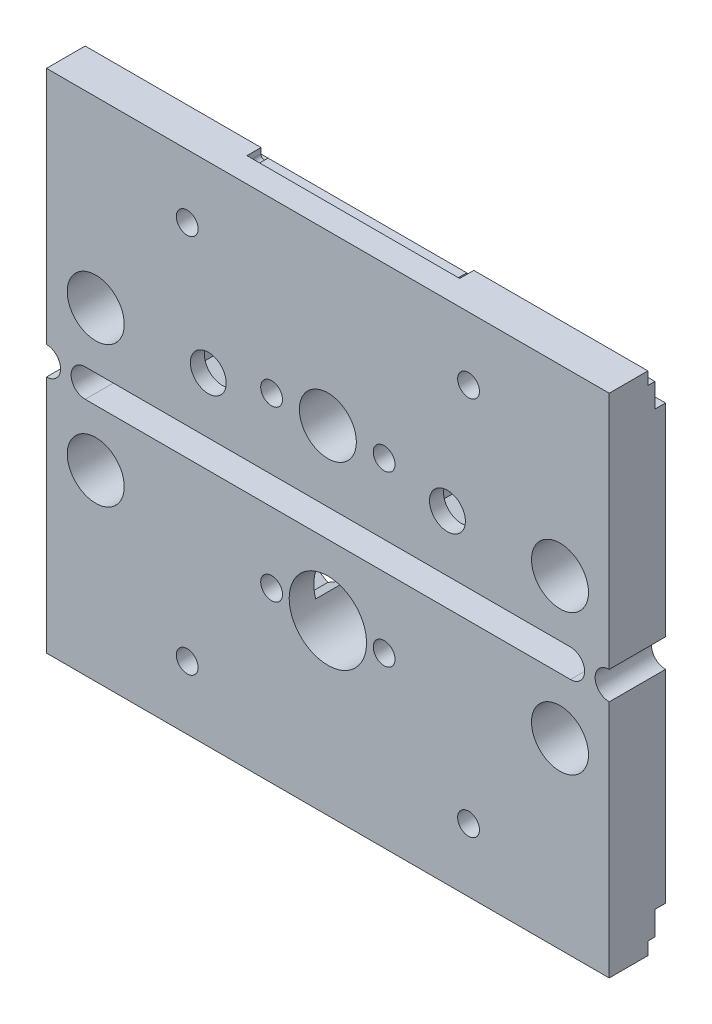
ISO-10303-21;
HEADER;
FILE_DESCRIPTION(('STEP AP214'),'2;1');
FILE_NAME('part.step','',(''),(''),'','','');
FILE_SCHEMA(('AUTOMOTIVE_DESIGN { 1 0 10303 214 1 1 1 1 }'));
ENDSEC;
DATA;
#1=APPLICATION_CONTEXT('core data for automotive mechanical design processes');
#2=APPLICATION_PROTOCOL_DEFINITION('international standard','automotive_design',2000,#1);
#3=PRODUCT_CONTEXT('',#1,'mechanical');
#4=PRODUCT('Part','Part','',(#3));
#5=PRODUCT_RELATED_PRODUCT_CATEGORY('part','',(#4));
#6=PRODUCT_DEFINITION_FORMATION('','',#4);
#7=PRODUCT_DEFINITION_CONTEXT('part definition',#1,'design');
#8=PRODUCT_DEFINITION('design','',#6,#7);
#9=PRODUCT_DEFINITION_SHAPE('','',#8);
#10=(LENGTH_UNIT() NAMED_UNIT(*) SI_UNIT(.MILLI.,.METRE.));
#11=(NAMED_UNIT(*) PLANE_ANGLE_UNIT() SI_UNIT($,.RADIAN.));
#12=(NAMED_UNIT(*) SI_UNIT($,.STERADIAN.) SOLID_ANGLE_UNIT());
#13=UNCERTAINTY_MEASURE_WITH_UNIT(LENGTH_MEASURE(1.E-05),#10,'distance_accuracy_value','');
#14=(GEOMETRIC_REPRESENTATION_CONTEXT(3) GLOBAL_UNCERTAINTY_ASSIGNED_CONTEXT((#13)) GLOBAL_UNIT_ASSIGNED_CONTEXT((#10,
#11,#12)) REPRESENTATION_CONTEXT('',''));
#15=CARTESIAN_POINT('',(0.,0.,0.));
#16=DIRECTION('',(0.,0.,1.));
#17=DIRECTION('',(1.,0.,0.));
#18=AXIS2_PLACEMENT_3D('',#15,#16,#17);
#19=CARTESIAN_POINT('',(80.,-38.,8.));
#20=DIRECTION('',(0.,-1.,0.));
#21=DIRECTION('',(1.,0.,0.));
#22=AXIS2_PLACEMENT_3D('',#19,#20,#21);
#23=PLANE('',#22);
#24=DIRECTION('',(1.,0.,0.));
#25=VECTOR('',#24,1.);
#26=CARTESIAN_POINT('',(-4.8988590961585E-11,-38.,2.5));
#27=LINE('',#26,#25);
#28=CARTESIAN_POINT('',(-4.8988590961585E-11,-38.,2.5));
#29=VERTEX_POINT('',#28);
#30=CARTESIAN_POINT('',(25.000000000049,-38.,2.49999999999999));
#31=VERTEX_POINT('',#30);
#32=EDGE_CURVE('E540',#29,#31,#27,.T.);
#33=ORIENTED_EDGE('',*,*,#32,.T.);
#34=DIRECTION('',(0.,0.,-1.));
#35=VECTOR('',#34,1.);
#36=CARTESIAN_POINT('',(25.000000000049,-38.,4.49999999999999));
#37=LINE('',#36,#35);
#38=CARTESIAN_POINT('',(25.000000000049,-38.,4.49999999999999));
#39=VERTEX_POINT('',#38);
#40=EDGE_CURVE('E2042',#39,#31,#37,.T.);
#41=ORIENTED_EDGE('',*,*,#40,.F.);
#42=DIRECTION('',(1.,0.,0.));
#43=VECTOR('',#42,1.);
#44=CARTESIAN_POINT('',(25.000000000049,-38.,4.49999999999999));
#45=LINE('',#44,#43);
#46=CARTESIAN_POINT('',(55.247938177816,-38.,4.49999999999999));
#47=VERTEX_POINT('',#46);
#48=EDGE_CURVE('E2050',#39,#47,#45,.T.);
#49=ORIENTED_EDGE('',*,*,#48,.T.);
#50=DIRECTION('',(0.,0.,-1.));
#51=VECTOR('',#50,1.);
#52=CARTESIAN_POINT('',(55.247938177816,-38.,4.49999999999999));
#53=LINE('',#52,#51);
#54=CARTESIAN_POINT('',(55.247938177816,-38.,2.49999999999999));
#55=VERTEX_POINT('',#54);
#56=EDGE_CURVE('E2056',#47,#55,#53,.T.);
#57=ORIENTED_EDGE('',*,*,#56,.T.);
#58=CARTESIAN_POINT('',(80.,-38.,2.5));
#59=VERTEX_POINT('',#58);
#60=EDGE_CURVE('E544',#55,#59,#27,.T.);
#61=ORIENTED_EDGE('',*,*,#60,.T.);
#62=DIRECTION('',(0.,0.,-1.));
#63=VECTOR('',#62,1.);
#64=CARTESIAN_POINT('',(80.,-38.,8.));
#65=LINE('',#64,#63);
#66=CARTESIAN_POINT('',(80.,-38.,8.));
#67=VERTEX_POINT('',#66);
#68=EDGE_CURVE('E575',#67,#59,#65,.T.);
#69=ORIENTED_EDGE('',*,*,#68,.F.);
#70=DIRECTION('',(-1.,0.,0.));
#71=VECTOR('',#70,1.);
#72=CARTESIAN_POINT('',(80.,-38.,8.));
#73=LINE('',#72,#71);
#74=CARTESIAN_POINT('',(0.,-38.,8.));
#75=VERTEX_POINT('',#74);
#76=EDGE_CURVE('E566',#67,#75,#73,.T.);
#77=ORIENTED_EDGE('',*,*,#76,.T.);
#78=DIRECTION('',(0.,0.,-1.));
#79=VECTOR('',#78,1.);
#80=CARTESIAN_POINT('',(0.,-38.,8.));
#81=LINE('',#80,#79);
#82=EDGE_CURVE('E584',#75,#29,#81,.T.);
#83=ORIENTED_EDGE('',*,*,#82,.T.);
#84=EDGE_LOOP('',(#33,#41,#49,#57,#61,#69,#77,#83));
#85=FACE_BOUND('',#84,.T.);
#86=ADVANCED_FACE('F33',(#85),#23,.T.);
#87=CARTESIAN_POINT('',(0.,0.,0.));
#88=DIRECTION('',(0.,0.,1.));
#89=DIRECTION('',(1.,0.,0.));
#90=AXIS2_PLACEMENT_3D('',#87,#88,#89);
#91=PLANE('',#90);
#92=CARTESIAN_POINT('',(60.,-29.,0.));
#93=DIRECTION('',(0.,0.,1.));
#94=DIRECTION('',(-1.,0.,0.));
#95=AXIS2_PLACEMENT_3D('',#92,#93,#94);
#96=CIRCLE('',#95,1.55);
#97=CARTESIAN_POINT('',(58.45,-29.,0.));
#98=VERTEX_POINT('',#97);
#99=EDGE_CURVE('E490',#98,#98,#96,.T.);
#100=ORIENTED_EDGE('',*,*,#99,.T.);
#101=EDGE_LOOP('',(#100));
#102=FACE_BOUND('',#101,.T.);
#103=CARTESIAN_POINT('',(19.9999999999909,-29.0000000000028,0.));
#104=DIRECTION('',(0.,0.,1.));
#105=DIRECTION('',(-1.,0.,0.));
#106=AXIS2_PLACEMENT_3D('',#103,#104,#105);
#107=CIRCLE('',#106,1.55);
#108=CARTESIAN_POINT('',(18.4499999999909,-29.0000000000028,0.));
#109=VERTEX_POINT('',#108);
#110=EDGE_CURVE('E2038',#109,#109,#107,.T.);
#111=ORIENTED_EDGE('',*,*,#110,.T.);
#112=EDGE_LOOP('',(#111));
#113=FACE_BOUND('',#112,.T.);
#114=DIRECTION('',(-0.866025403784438,-0.5,0.));
#115=VECTOR('',#114,1.);
#116=CARTESIAN_POINT('',(48.,-10.7091034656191,0.));
#117=LINE('',#116,#115);
#118=CARTESIAN_POINT('',(48.,-10.7091034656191,0.));
#119=VERTEX_POINT('',#118);
#120=CARTESIAN_POINT('',(45.2328562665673,-12.3067146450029,0.));
#121=VERTEX_POINT('',#120);
#122=EDGE_CURVE('E475',#119,#121,#117,.T.);
#123=ORIENTED_EDGE('',*,*,#122,.T.);
#124=CARTESIAN_POINT('',(40.,-14.,0.));
#125=DIRECTION('',(0.,0.,-1.));
#126=DIRECTION('',(-1.,0.,0.));
#127=AXIS2_PLACEMENT_3D('',#124,#125,#126);
#128=CIRCLE('',#127,5.5);
#129=CARTESIAN_POINT('',(34.7671437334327,-12.3067146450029,0.));
#130=VERTEX_POINT('',#129);
#131=EDGE_CURVE('E460',#130,#121,#128,.T.);
#132=ORIENTED_EDGE('',*,*,#131,.F.);
#133=DIRECTION('',(-0.86602540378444,0.499999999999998,0.));
#134=VECTOR('',#133,1.);
#135=CARTESIAN_POINT('',(34.85,-12.3545517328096,0.));
#136=LINE('',#135,#134);
#137=CARTESIAN_POINT('',(32.,-10.7091034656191,0.));
#138=VERTEX_POINT('',#137);
#139=EDGE_CURVE('E472',#130,#138,#136,.T.);
#140=ORIENTED_EDGE('',*,*,#139,.T.);
#141=DIRECTION('',(-0.866025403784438,-0.500000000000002,0.));
#142=VECTOR('',#141,1.);
#143=CARTESIAN_POINT('',(32.,-10.7091034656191,0.));
#144=LINE('',#143,#142);
#145=CARTESIAN_POINT('',(29.15,-12.3545517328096,0.));
#146=VERTEX_POINT('',#145);
#147=EDGE_CURVE('E501',#138,#146,#144,.T.);
#148=ORIENTED_EDGE('',*,*,#147,.T.);
#149=DIRECTION('',(0.,-1.,0.));
#150=VECTOR('',#149,1.);
#151=CARTESIAN_POINT('',(29.15,-12.3545517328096,0.));
#152=LINE('',#151,#150);
#153=CARTESIAN_POINT('',(29.15,-15.6454482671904,0.));
#154=VERTEX_POINT('',#153);
#155=EDGE_CURVE('E498',#146,#154,#152,.T.);
#156=ORIENTED_EDGE('',*,*,#155,.T.);
#157=DIRECTION('',(0.866025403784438,-0.500000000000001,0.));
#158=VECTOR('',#157,1.);
#159=CARTESIAN_POINT('',(29.15,-15.6454482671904,0.));
#160=LINE('',#159,#158);
#161=CARTESIAN_POINT('',(32.,-17.2908965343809,0.));
#162=VERTEX_POINT('',#161);
#163=EDGE_CURVE('E487',#154,#162,#160,.T.);
#164=ORIENTED_EDGE('',*,*,#163,.T.);
#165=DIRECTION('',(0.866025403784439,0.5,0.));
#166=VECTOR('',#165,1.);
#167=CARTESIAN_POINT('',(32.,-17.2908965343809,0.));
#168=LINE('',#167,#166);
#169=CARTESIAN_POINT('',(34.7671437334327,-15.6932853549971,0.));
#170=VERTEX_POINT('',#169);
#171=EDGE_CURVE('E483',#162,#170,#168,.T.);
#172=ORIENTED_EDGE('',*,*,#171,.T.);
#173=CARTESIAN_POINT('',(45.2328562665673,-15.6932853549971,0.));
#174=VERTEX_POINT('',#173);
#175=EDGE_CURVE('E477',#174,#170,#128,.T.);
#176=ORIENTED_EDGE('',*,*,#175,.F.);
#177=DIRECTION('',(0.866025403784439,-0.499999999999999,0.));
#178=VECTOR('',#177,1.);
#179=CARTESIAN_POINT('',(45.15,-15.6454482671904,0.));
#180=LINE('',#179,#178);
#181=CARTESIAN_POINT('',(48.,-17.2908965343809,0.));
#182=VERTEX_POINT('',#181);
#183=EDGE_CURVE('E2001',#174,#182,#180,.T.);
#184=ORIENTED_EDGE('',*,*,#183,.T.);
#185=DIRECTION('',(0.866025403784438,0.5,0.));
#186=VECTOR('',#185,1.);
#187=CARTESIAN_POINT('',(48.,-17.2908965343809,0.));
#188=LINE('',#187,#186);
#189=CARTESIAN_POINT('',(50.85,-15.6454482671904,0.));
#190=VERTEX_POINT('',#189);
#191=EDGE_CURVE('E1998',#182,#190,#188,.T.);
#192=ORIENTED_EDGE('',*,*,#191,.T.);
#193=DIRECTION('',(0.,1.,0.));
#194=VECTOR('',#193,1.);
#195=CARTESIAN_POINT('',(50.85,-15.6454482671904,0.));
#196=LINE('',#195,#194);
#197=CARTESIAN_POINT('',(50.85,-12.3545517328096,0.));
#198=VERTEX_POINT('',#197);
#199=EDGE_CURVE('E1995',#190,#198,#196,.T.);
#200=ORIENTED_EDGE('',*,*,#199,.T.);
#201=DIRECTION('',(-0.866025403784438,0.5,0.));
#202=VECTOR('',#201,1.);
#203=CARTESIAN_POINT('',(50.85,-12.3545517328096,0.));
#204=LINE('',#203,#202);
#205=EDGE_CURVE('E505',#198,#119,#204,.T.);
#206=ORIENTED_EDGE('',*,*,#205,.T.);
#207=EDGE_LOOP('',(#123,#132,#140,#148,#156,#164,#172,#176,#184,#192,#200,#206));
#208=FACE_BOUND('',#207,.T.);
#209=CARTESIAN_POINT('',(7.,-12.,0.));
#210=DIRECTION('',(0.,0.,-1.));
#211=DIRECTION('',(1.,0.,0.));
#212=AXIS2_PLACEMENT_3D('',#209,#210,#211);
#213=CIRCLE('',#212,4.05);
#214=CARTESIAN_POINT('',(11.05,-12.,0.));
#215=VERTEX_POINT('',#214);
#216=EDGE_CURVE('E555',#215,#215,#213,.T.);
#217=ORIENTED_EDGE('',*,*,#216,.F.);
#218=EDGE_LOOP('',(#217));
#219=FACE_BOUND('',#218,.T.);
#220=CARTESIAN_POINT('',(73.,-12.,0.));
#221=DIRECTION('',(0.,0.,-1.));
#222=DIRECTION('',(1.,0.,0.));
#223=AXIS2_PLACEMENT_3D('',#220,#221,#222);
#224=CIRCLE('',#223,4.05);
#225=CARTESIAN_POINT('',(77.05,-12.,0.));
#226=VERTEX_POINT('',#225);
#227=EDGE_CURVE('E543',#226,#226,#224,.T.);
#228=ORIENTED_EDGE('',*,*,#227,.F.);
#229=EDGE_LOOP('',(#228));
#230=FACE_BOUND('',#229,.T.);
#231=CARTESIAN_POINT('',(73.,8.,0.));
#232=DIRECTION('',(0.,0.,1.));
#233=DIRECTION('',(1.,0.,0.));
#234=AXIS2_PLACEMENT_3D('',#231,#232,#233);
#235=CIRCLE('',#234,4.05);
#236=CARTESIAN_POINT('',(77.05,8.,0.));
#237=VERTEX_POINT('',#236);
#238=EDGE_CURVE('E925',#237,#237,#235,.T.);
#239=ORIENTED_EDGE('',*,*,#238,.T.);
#240=EDGE_LOOP('',(#239));
#241=FACE_BOUND('',#240,.T.);
#242=CARTESIAN_POINT('',(40.,10.,0.));
#243=DIRECTION('',(0.,0.,1.));
#244=DIRECTION('',(1.,0.,0.));
#245=AXIS2_PLACEMENT_3D('',#242,#243,#244);
#246=CIRCLE('',#245,4.05);
#247=CARTESIAN_POINT('',(44.05,10.,0.));
#248=VERTEX_POINT('',#247);
#249=EDGE_CURVE('E931',#248,#248,#246,.T.);
#250=ORIENTED_EDGE('',*,*,#249,.T.);
#251=EDGE_LOOP('',(#250));
#252=FACE_BOUND('',#251,.T.);
#253=CARTESIAN_POINT('',(7.,8.,0.));
#254=DIRECTION('',(0.,0.,1.));
#255=DIRECTION('',(1.,0.,0.));
#256=AXIS2_PLACEMENT_3D('',#253,#254,#255);
#257=CIRCLE('',#256,4.05);
#258=CARTESIAN_POINT('',(11.05,8.,0.));
#259=VERTEX_POINT('',#258);
#260=EDGE_CURVE('E937',#259,#259,#257,.T.);
#261=ORIENTED_EDGE('',*,*,#260,.T.);
#262=EDGE_LOOP('',(#261));
#263=FACE_BOUND('',#262,.T.);
#264=DIRECTION('',(1.,0.,0.));
#265=VECTOR('',#264,1.);
#266=CARTESIAN_POINT('',(0.,-4.,0.));
#267=LINE('',#266,#265);
#268=CARTESIAN_POINT('',(5.49999999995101,-4.,0.));
#269=VERTEX_POINT('',#268);
#270=CARTESIAN_POINT('',(74.5,-4.,0.));
#271=VERTEX_POINT('',#270);
#272=EDGE_CURVE('E567',#269,#271,#267,.T.);
#273=ORIENTED_EDGE('',*,*,#272,.T.);
#274=CARTESIAN_POINT('',(74.5,-2.00000000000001,0.));
#275=DIRECTION('',(0.,0.,-1.));
#276=DIRECTION('',(1.,0.,0.));
#277=AXIS2_PLACEMENT_3D('',#274,#275,#276);
#278=CIRCLE('',#277,2.00000000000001);
#279=CARTESIAN_POINT('',(74.5,0.,0.));
#280=VERTEX_POINT('',#279);
#281=EDGE_CURVE('E610',#280,#271,#278,.T.);
#282=ORIENTED_EDGE('',*,*,#281,.F.);
#283=DIRECTION('',(1.,0.,0.));
#284=VECTOR('',#283,1.);
#285=CARTESIAN_POINT('',(0.,0.,0.));
#286=LINE('',#285,#284);
#287=CARTESIAN_POINT('',(5.49999999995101,0.,0.));
#288=VERTEX_POINT('',#287);
#289=EDGE_CURVE('E957',#288,#280,#286,.T.);
#290=ORIENTED_EDGE('',*,*,#289,.F.);
#291=CARTESIAN_POINT('',(5.49999999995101,-2.00000000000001,0.));
#292=DIRECTION('',(0.,0.,-1.));
#293=DIRECTION('',(1.,0.,0.));
#294=AXIS2_PLACEMENT_3D('',#291,#292,#293);
#295=CIRCLE('',#294,2.);
#296=EDGE_CURVE('E588',#269,#288,#295,.T.);
#297=ORIENTED_EDGE('',*,*,#296,.F.);
#298=EDGE_LOOP('',(#273,#282,#290,#297));
#299=FACE_BOUND('',#298,.T.);
#300=DIRECTION('',(-0.866025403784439,-0.499999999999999,0.));
#301=VECTOR('',#300,1.);
#302=CARTESIAN_POINT('',(27.1,5.63286389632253,0.));
#303=LINE('',#302,#301);
#304=CARTESIAN_POINT('',(27.1,5.63286389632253,0.));
#305=VERTEX_POINT('',#304);
#306=CARTESIAN_POINT('',(23.,3.26572779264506,0.));
#307=VERTEX_POINT('',#306);
#308=EDGE_CURVE('E852',#305,#307,#303,.T.);
#309=ORIENTED_EDGE('',*,*,#308,.F.);
#310=DIRECTION('',(0.,-1.,0.));
#311=VECTOR('',#310,1.);
#312=CARTESIAN_POINT('',(27.1,10.3671361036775,0.));
#313=LINE('',#312,#311);
#314=CARTESIAN_POINT('',(27.1,10.3671361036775,0.));
#315=VERTEX_POINT('',#314);
#316=EDGE_CURVE('E850',#315,#305,#313,.T.);
#317=ORIENTED_EDGE('',*,*,#316,.F.);
#318=DIRECTION('',(0.866025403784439,-0.5,0.));
#319=VECTOR('',#318,1.);
#320=CARTESIAN_POINT('',(23.,12.7342722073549,0.));
#321=LINE('',#320,#319);
#322=CARTESIAN_POINT('',(23.,12.7342722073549,0.));
#323=VERTEX_POINT('',#322);
#324=EDGE_CURVE('E834',#323,#315,#321,.T.);
#325=ORIENTED_EDGE('',*,*,#324,.F.);
#326=DIRECTION('',(0.866025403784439,0.5,0.));
#327=VECTOR('',#326,1.);
#328=CARTESIAN_POINT('',(18.9,10.3671361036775,0.));
#329=LINE('',#328,#327);
#330=CARTESIAN_POINT('',(18.9,10.3671361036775,0.));
#331=VERTEX_POINT('',#330);
#332=EDGE_CURVE('E862',#331,#323,#329,.T.);
#333=ORIENTED_EDGE('',*,*,#332,.F.);
#334=DIRECTION('',(0.,1.,0.));
#335=VECTOR('',#334,1.);
#336=CARTESIAN_POINT('',(18.9,5.63286389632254,0.));
#337=LINE('',#336,#335);
#338=CARTESIAN_POINT('',(18.9,5.63286389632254,0.));
#339=VERTEX_POINT('',#338);
#340=EDGE_CURVE('E859',#339,#331,#337,.T.);
#341=ORIENTED_EDGE('',*,*,#340,.F.);
#342=DIRECTION('',(-0.866025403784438,0.500000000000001,0.));
#343=VECTOR('',#342,1.);
#344=CARTESIAN_POINT('',(23.,3.26572779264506,0.));
#345=LINE('',#344,#343);
#346=EDGE_CURVE('E856',#307,#339,#345,.T.);
#347=ORIENTED_EDGE('',*,*,#346,.F.);
#348=EDGE_LOOP('',(#309,#317,#325,#333,#341,#347));
#349=FACE_BOUND('',#348,.T.);
#350=DIRECTION('',(0.,1.,0.));
#351=VECTOR('',#350,1.);
#352=CARTESIAN_POINT('',(52.9,5.63286389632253,0.));
#353=LINE('',#352,#351);
#354=CARTESIAN_POINT('',(52.9,5.63286389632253,0.));
#355=VERTEX_POINT('',#354);
#356=CARTESIAN_POINT('',(52.9,10.3671361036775,0.));
#357=VERTEX_POINT('',#356);
#358=EDGE_CURVE('E802',#355,#357,#353,.T.);
#359=ORIENTED_EDGE('',*,*,#358,.F.);
#360=DIRECTION('',(-0.866025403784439,0.5,0.));
#361=VECTOR('',#360,1.);
#362=CARTESIAN_POINT('',(57.,3.26572779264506,0.));
#363=LINE('',#362,#361);
#364=CARTESIAN_POINT('',(57.,3.26572779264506,0.));
#365=VERTEX_POINT('',#364);
#366=EDGE_CURVE('E800',#365,#355,#363,.T.);
#367=ORIENTED_EDGE('',*,*,#366,.F.);
#368=DIRECTION('',(-0.866025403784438,-0.5,0.));
#369=VECTOR('',#368,1.);
#370=CARTESIAN_POINT('',(61.1,5.63286389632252,0.));
#371=LINE('',#370,#369);
#372=CARTESIAN_POINT('',(61.1,5.63286389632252,0.));
#373=VERTEX_POINT('',#372);
#374=EDGE_CURVE('E784',#373,#365,#371,.T.);
#375=ORIENTED_EDGE('',*,*,#374,.F.);
#376=DIRECTION('',(0.,-1.,0.));
#377=VECTOR('',#376,1.);
#378=CARTESIAN_POINT('',(61.1,10.3671361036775,0.));
#379=LINE('',#378,#377);
#380=CARTESIAN_POINT('',(61.1,10.3671361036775,0.));
#381=VERTEX_POINT('',#380);
#382=EDGE_CURVE('E812',#381,#373,#379,.T.);
#383=ORIENTED_EDGE('',*,*,#382,.F.);
#384=DIRECTION('',(0.866025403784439,-0.5,0.));
#385=VECTOR('',#384,1.);
#386=CARTESIAN_POINT('',(57.,12.7342722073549,0.));
#387=LINE('',#386,#385);
#388=CARTESIAN_POINT('',(57.,12.7342722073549,0.));
#389=VERTEX_POINT('',#388);
#390=EDGE_CURVE('E809',#389,#381,#387,.T.);
#391=ORIENTED_EDGE('',*,*,#390,.F.);
#392=DIRECTION('',(0.866025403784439,0.5,0.));
#393=VECTOR('',#392,1.);
#394=CARTESIAN_POINT('',(52.9,10.3671361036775,0.));
#395=LINE('',#394,#393);
#396=EDGE_CURVE('E806',#357,#389,#395,.T.);
#397=ORIENTED_EDGE('',*,*,#396,.F.);
#398=EDGE_LOOP('',(#359,#367,#375,#383,#391,#397));
#399=FACE_BOUND('',#398,.T.);
#400=DIRECTION('',(-0.866025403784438,0.500000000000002,0.));
#401=VECTOR('',#400,1.);
#402=CARTESIAN_POINT('',(32.,6.70910346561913,0.));
#403=LINE('',#402,#401);
#404=CARTESIAN_POINT('',(32.,6.70910346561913,0.));
#405=VERTEX_POINT('',#404);
#406=CARTESIAN_POINT('',(29.15,8.35455173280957,0.));
#407=VERTEX_POINT('',#406);
#408=EDGE_CURVE('E755',#405,#407,#403,.T.);
#409=ORIENTED_EDGE('',*,*,#408,.F.);
#410=DIRECTION('',(-0.86602540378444,-0.499999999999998,0.));
#411=VECTOR('',#410,1.);
#412=CARTESIAN_POINT('',(34.85,8.35455173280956,0.));
#413=LINE('',#412,#411);
#414=CARTESIAN_POINT('',(34.85,8.35455173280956,0.));
#415=VERTEX_POINT('',#414);
#416=EDGE_CURVE('E675',#415,#405,#413,.T.);
#417=ORIENTED_EDGE('',*,*,#416,.F.);
#418=DIRECTION('',(0.,-1.,0.));
#419=VECTOR('',#418,1.);
#420=CARTESIAN_POINT('',(34.85,11.6454482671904,0.));
#421=LINE('',#420,#419);
#422=CARTESIAN_POINT('',(34.85,11.6454482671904,0.));
#423=VERTEX_POINT('',#422);
#424=EDGE_CURVE('E738',#423,#415,#421,.T.);
#425=ORIENTED_EDGE('',*,*,#424,.F.);
#426=DIRECTION('',(0.866025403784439,-0.5,0.));
#427=VECTOR('',#426,1.);
#428=CARTESIAN_POINT('',(32.,13.2908965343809,0.));
#429=LINE('',#428,#427);
#430=CARTESIAN_POINT('',(32.,13.2908965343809,0.));
#431=VERTEX_POINT('',#430);
#432=EDGE_CURVE('E764',#431,#423,#429,.T.);
#433=ORIENTED_EDGE('',*,*,#432,.F.);
#434=DIRECTION('',(0.866025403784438,0.500000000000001,0.));
#435=VECTOR('',#434,1.);
#436=CARTESIAN_POINT('',(29.15,11.6454482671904,0.));
#437=LINE('',#436,#435);
#438=CARTESIAN_POINT('',(29.15,11.6454482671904,0.));
#439=VERTEX_POINT('',#438);
#440=EDGE_CURVE('E761',#439,#431,#437,.T.);
#441=ORIENTED_EDGE('',*,*,#440,.F.);
#442=DIRECTION('',(0.,1.,0.));
#443=VECTOR('',#442,1.);
#444=CARTESIAN_POINT('',(29.15,8.35455173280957,0.));
#445=LINE('',#444,#443);
#446=EDGE_CURVE('E758',#407,#439,#445,.T.);
#447=ORIENTED_EDGE('',*,*,#446,.F.);
#448=EDGE_LOOP('',(#409,#417,#425,#433,#441,#447));
#449=FACE_BOUND('',#448,.T.);
#450=DIRECTION('',(-0.866025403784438,0.5,0.));
#451=VECTOR('',#450,1.);
#452=CARTESIAN_POINT('',(48.,6.70910346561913,0.));
#453=LINE('',#452,#451);
#454=CARTESIAN_POINT('',(48.,6.70910346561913,0.));
#455=VERTEX_POINT('',#454);
#456=CARTESIAN_POINT('',(45.15,8.35455173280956,0.));
#457=VERTEX_POINT('',#456);
#458=EDGE_CURVE('E706',#455,#457,#453,.T.);
#459=ORIENTED_EDGE('',*,*,#458,.F.);
#460=DIRECTION('',(-0.866025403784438,-0.5,0.));
#461=VECTOR('',#460,1.);
#462=CARTESIAN_POINT('',(50.85,8.35455173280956,0.));
#463=LINE('',#462,#461);
#464=CARTESIAN_POINT('',(50.85,8.35455173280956,0.));
#465=VERTEX_POINT('',#464);
#466=EDGE_CURVE('E704',#465,#455,#463,.T.);
#467=ORIENTED_EDGE('',*,*,#466,.F.);
#468=DIRECTION('',(0.,-1.,0.));
#469=VECTOR('',#468,1.);
#470=CARTESIAN_POINT('',(50.85,11.6454482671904,0.));
#471=LINE('',#470,#469);
#472=CARTESIAN_POINT('',(50.85,11.6454482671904,0.));
#473=VERTEX_POINT('',#472);
#474=EDGE_CURVE('E688',#473,#465,#471,.T.);
#475=ORIENTED_EDGE('',*,*,#474,.F.);
#476=DIRECTION('',(0.866025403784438,-0.5,0.));
#477=VECTOR('',#476,1.);
#478=CARTESIAN_POINT('',(48.,13.2908965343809,0.));
#479=LINE('',#478,#477);
#480=CARTESIAN_POINT('',(48.,13.2908965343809,0.));
#481=VERTEX_POINT('',#480);
#482=EDGE_CURVE('E716',#481,#473,#479,.T.);
#483=ORIENTED_EDGE('',*,*,#482,.F.);
#484=DIRECTION('',(0.866025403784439,0.499999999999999,0.));
#485=VECTOR('',#484,1.);
#486=CARTESIAN_POINT('',(45.15,11.6454482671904,0.));
#487=LINE('',#486,#485);
#488=CARTESIAN_POINT('',(45.15,11.6454482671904,0.));
#489=VERTEX_POINT('',#488);
#490=EDGE_CURVE('E713',#489,#481,#487,.T.);
#491=ORIENTED_EDGE('',*,*,#490,.F.);
#492=DIRECTION('',(0.,1.,0.));
#493=VECTOR('',#492,1.);
#494=CARTESIAN_POINT('',(45.15,8.35455173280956,0.));
#495=LINE('',#494,#493);
#496=EDGE_CURVE('E710',#457,#489,#495,.T.);
#497=ORIENTED_EDGE('',*,*,#496,.F.);
#498=EDGE_LOOP('',(#459,#467,#475,#483,#491,#497));
#499=FACE_BOUND('',#498,.T.);
#500=CARTESIAN_POINT('',(19.9999999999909,25.0000000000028,0.));
#501=DIRECTION('',(0.,0.,-1.));
#502=DIRECTION('',(-1.,0.,0.));
#503=AXIS2_PLACEMENT_3D('',#500,#501,#502);
#504=CIRCLE('',#503,1.55);
#505=CARTESIAN_POINT('',(18.4499999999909,25.0000000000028,0.));
#506=VERTEX_POINT('',#505);
#507=EDGE_CURVE('E661',#506,#506,#504,.T.);
#508=ORIENTED_EDGE('',*,*,#507,.F.);
#509=EDGE_LOOP('',(#508));
#510=FACE_BOUND('',#509,.T.);
#511=CARTESIAN_POINT('',(60.,25.,0.));
#512=DIRECTION('',(0.,0.,-1.));
#513=DIRECTION('',(-1.,0.,0.));
#514=AXIS2_PLACEMENT_3D('',#511,#512,#513);
#515=CIRCLE('',#514,1.55);
#516=CARTESIAN_POINT('',(58.45,25.,0.));
#517=VERTEX_POINT('',#516);
#518=EDGE_CURVE('E676',#517,#517,#515,.T.);
#519=ORIENTED_EDGE('',*,*,#518,.F.);
#520=EDGE_LOOP('',(#519));
#521=FACE_BOUND('',#520,.T.);
#522=DIRECTION('',(1.,0.,0.));
#523=VECTOR('',#522,1.);
#524=CARTESIAN_POINT('',(-4.8988590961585E-11,-32.7999999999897,0.));
#525=LINE('',#524,#523);
#526=CARTESIAN_POINT('',(-4.8988590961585E-11,-32.7999999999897,0.));
#527=VERTEX_POINT('',#526);
#528=CARTESIAN_POINT('',(80.,-32.7999999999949,0.));
#529=VERTEX_POINT('',#528);
#530=EDGE_CURVE('E529',#527,#529,#525,.T.);
#531=ORIENTED_EDGE('',*,*,#530,.F.);
#532=DIRECTION('',(0.,1.,0.));
#533=VECTOR('',#532,1.);
#534=CARTESIAN_POINT('',(0.,-38.,0.));
#535=LINE('',#534,#533);
#536=CARTESIAN_POINT('',(0.,-4.,0.));
#537=VERTEX_POINT('',#536);
#538=EDGE_CURVE('E561',#527,#537,#535,.T.);
#539=ORIENTED_EDGE('',*,*,#538,.T.);
#540=CARTESIAN_POINT('',(-4.89859888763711E-11,-2.00000000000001,0.));
#541=DIRECTION('',(0.,0.,-1.));
#542=DIRECTION('',(1.,0.,0.));
#543=AXIS2_PLACEMENT_3D('',#540,#541,#542);
#544=CIRCLE('',#543,2.);
#545=CARTESIAN_POINT('',(-4.89858664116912E-11,0.,0.));
#546=VERTEX_POINT('',#545);
#547=EDGE_CURVE('E591',#546,#537,#544,.T.);
#548=ORIENTED_EDGE('',*,*,#547,.F.);
#549=DIRECTION('',(0.,-1.,0.));
#550=VECTOR('',#549,1.);
#551=CARTESIAN_POINT('',(0.,34.,0.));
#552=LINE('',#551,#550);
#553=CARTESIAN_POINT('',(0.,28.7999999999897,0.));
#554=VERTEX_POINT('',#553);
#555=EDGE_CURVE('E943',#554,#546,#552,.T.);
#556=ORIENTED_EDGE('',*,*,#555,.F.);
#557=DIRECTION('',(1.,0.,0.));
#558=VECTOR('',#557,1.);
#559=CARTESIAN_POINT('',(0.,28.7999999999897,0.));
#560=LINE('',#559,#558);
#561=CARTESIAN_POINT('',(80.,28.7999999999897,0.));
#562=VERTEX_POINT('',#561);
#563=EDGE_CURVE('E909',#554,#562,#560,.T.);
#564=ORIENTED_EDGE('',*,*,#563,.T.);
#565=DIRECTION('',(0.,1.,0.));
#566=VECTOR('',#565,1.);
#567=CARTESIAN_POINT('',(80.,0.,0.));
#568=LINE('',#567,#566);
#569=CARTESIAN_POINT('',(80.,0.,0.));
#570=VERTEX_POINT('',#569);
#571=EDGE_CURVE('E949',#570,#562,#568,.T.);
#572=ORIENTED_EDGE('',*,*,#571,.F.);
#573=CARTESIAN_POINT('',(80.,-2.,0.));
#574=DIRECTION('',(0.,0.,-1.));
#575=DIRECTION('',(1.,0.,0.));
#576=AXIS2_PLACEMENT_3D('',#573,#574,#575);
#577=CIRCLE('',#576,2.);
#578=CARTESIAN_POINT('',(80.,-4.,0.));
#579=VERTEX_POINT('',#578);
#580=EDGE_CURVE('E608',#579,#570,#577,.T.);
#581=ORIENTED_EDGE('',*,*,#580,.F.);
#582=DIRECTION('',(0.,-1.,0.));
#583=VECTOR('',#582,1.);
#584=CARTESIAN_POINT('',(80.,-4.,0.));
#585=LINE('',#584,#583);
#586=EDGE_CURVE('E577',#579,#529,#585,.T.);
#587=ORIENTED_EDGE('',*,*,#586,.T.);
#588=EDGE_LOOP('',(#531,#539,#548,#556,#564,#572,#581,#587));
#589=FACE_BOUND('',#588,.T.);
#590=ADVANCED_FACE('F469',(#102,#113,#208,#219,#230,#241,#252,#263,#299,#349,#399,#449,#499,
#510,#521,#589),#91,.F.);
#591=CARTESIAN_POINT('',(32.,-14.,0.));
#592=DIRECTION('',(0.,0.,1.));
#593=DIRECTION('',(1.,0.,0.));
#594=AXIS2_PLACEMENT_3D('',#591,#592,#593);
#595=CYLINDRICAL_SURFACE('',#594,1.55);
#596=CARTESIAN_POINT('',(32.,-14.,8.));
#597=DIRECTION('',(0.,0.,-1.));
#598=DIRECTION('',(1.,0.,0.));
#599=AXIS2_PLACEMENT_3D('',#596,#597,#598);
#600=CIRCLE('',#599,1.55);
#601=CARTESIAN_POINT('',(33.55,-14.,8.));
#602=VERTEX_POINT('',#601);
#603=EDGE_CURVE('E516',#602,#602,#600,.T.);
#604=ORIENTED_EDGE('',*,*,#603,.F.);
#605=EDGE_LOOP('',(#604));
#606=FACE_BOUND('',#605,.T.);
#607=CARTESIAN_POINT('',(32.,-14.,4.5));
#608=DIRECTION('',(0.,0.,-1.));
#609=DIRECTION('',(-1.,0.,0.));
#610=AXIS2_PLACEMENT_3D('',#607,#608,#609);
#611=CIRCLE('',#610,1.55);
#612=CARTESIAN_POINT('',(30.45,-14.,4.5));
#613=VERTEX_POINT('',#612);
#614=EDGE_CURVE('E519',#613,#613,#611,.T.);
#615=ORIENTED_EDGE('',*,*,#614,.T.);
#616=EDGE_LOOP('',(#615));
#617=FACE_BOUND('',#616,.T.);
#618=ADVANCED_FACE('F985',(#606,#617),#595,.F.);
#619=CARTESIAN_POINT('',(48.,-14.,0.));
#620=DIRECTION('',(0.,0.,1.));
#621=DIRECTION('',(1.,0.,0.));
#622=AXIS2_PLACEMENT_3D('',#619,#620,#621);
#623=CYLINDRICAL_SURFACE('',#622,1.55);
#624=CARTESIAN_POINT('',(48.,-14.,8.));
#625=DIRECTION('',(0.,0.,-1.));
#626=DIRECTION('',(1.,0.,0.));
#627=AXIS2_PLACEMENT_3D('',#624,#625,#626);
#628=CIRCLE('',#627,1.55);
#629=CARTESIAN_POINT('',(49.55,-14.,8.));
#630=VERTEX_POINT('',#629);
#631=EDGE_CURVE('E512',#630,#630,#628,.T.);
#632=ORIENTED_EDGE('',*,*,#631,.F.);
#633=EDGE_LOOP('',(#632));
#634=FACE_BOUND('',#633,.T.);
#635=CARTESIAN_POINT('',(48.,-14.,4.5));
#636=DIRECTION('',(0.,0.,-1.));
#637=DIRECTION('',(-1.,0.,0.));
#638=AXIS2_PLACEMENT_3D('',#635,#636,#637);
#639=CIRCLE('',#638,1.55);
#640=CARTESIAN_POINT('',(46.45,-14.,4.5));
#641=VERTEX_POINT('',#640);
#642=EDGE_CURVE('E979',#641,#641,#639,.T.);
#643=ORIENTED_EDGE('',*,*,#642,.T.);
#644=EDGE_LOOP('',(#643));
#645=FACE_BOUND('',#644,.T.);
#646=ADVANCED_FACE('F1020',(#634,#645),#623,.F.);
#647=CARTESIAN_POINT('',(0.,-38.,8.));
#648=DIRECTION('',(-1.,0.,0.));
#649=DIRECTION('',(0.,0.,1.));
#650=AXIS2_PLACEMENT_3D('',#647,#648,#649);
#651=PLANE('',#650);
#652=DIRECTION('',(0.,0.,-1.));
#653=VECTOR('',#652,1.);
#654=CARTESIAN_POINT('',(-4.8988590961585E-11,-36.2,1.5));
#655=LINE('',#654,#653);
#656=CARTESIAN_POINT('',(-4.8988590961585E-11,-36.2,2.5));
#657=VERTEX_POINT('',#656);
#658=CARTESIAN_POINT('',(-4.8988590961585E-11,-36.2,1.5));
#659=VERTEX_POINT('',#658);
#660=EDGE_CURVE('E525',#657,#659,#655,.T.);
#661=ORIENTED_EDGE('',*,*,#660,.F.);
#662=DIRECTION('',(0.,1.,0.));
#663=VECTOR('',#662,1.);
#664=CARTESIAN_POINT('',(-4.8988590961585E-11,-36.2,2.5));
#665=LINE('',#664,#663);
#666=EDGE_CURVE('E527',#29,#657,#665,.T.);
#667=ORIENTED_EDGE('',*,*,#666,.F.);
#668=ORIENTED_EDGE('',*,*,#82,.F.);
#669=DIRECTION('',(0.,1.,0.));
#670=VECTOR('',#669,1.);
#671=CARTESIAN_POINT('',(0.,-38.,8.));
#672=LINE('',#671,#670);
#673=CARTESIAN_POINT('',(-4.89859888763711E-11,-4.00000000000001,8.));
#674=VERTEX_POINT('',#673);
#675=EDGE_CURVE('E564',#75,#674,#672,.T.);
#676=ORIENTED_EDGE('',*,*,#675,.T.);
#677=DIRECTION('',(0.,0.,1.));
#678=VECTOR('',#677,1.);
#679=CARTESIAN_POINT('',(-4.89859888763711E-11,-4.00000000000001,0.));
#680=LINE('',#679,#678);
#681=EDGE_CURVE('E603',#537,#674,#680,.T.);
#682=ORIENTED_EDGE('',*,*,#681,.F.);
#683=ORIENTED_EDGE('',*,*,#538,.F.);
#684=DIRECTION('',(0.,6.85562717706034E-12,-1.));
#685=VECTOR('',#684,1.);
#686=CARTESIAN_POINT('',(-4.8988590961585E-11,-32.8,1.5));
#687=LINE('',#686,#685);
#688=CARTESIAN_POINT('',(-4.8988590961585E-11,-32.8,1.5));
#689=VERTEX_POINT('',#688);
#690=EDGE_CURVE('E520',#689,#527,#687,.T.);
#691=ORIENTED_EDGE('',*,*,#690,.F.);
#692=DIRECTION('',(0.,1.,0.));
#693=VECTOR('',#692,1.);
#694=CARTESIAN_POINT('',(-4.8988590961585E-11,-36.2,1.5));
#695=LINE('',#694,#693);
#696=EDGE_CURVE('E522',#659,#689,#695,.T.);
#697=ORIENTED_EDGE('',*,*,#696,.F.);
#698=EDGE_LOOP('',(#661,#667,#668,#676,#682,#683,#691,#697));
#699=FACE_BOUND('',#698,.T.);
#700=ADVANCED_FACE('F1017',(#699),#651,.T.);
#701=CARTESIAN_POINT('',(80.,-4.,8.));
#702=DIRECTION('',(1.,0.,0.));
#703=DIRECTION('',(0.,0.,-1.));
#704=AXIS2_PLACEMENT_3D('',#701,#702,#703);
#705=PLANE('',#704);
#706=ORIENTED_EDGE('',*,*,#68,.T.);
#707=DIRECTION('',(0.,1.,0.));
#708=VECTOR('',#707,1.);
#709=CARTESIAN_POINT('',(80.,-36.2,2.5));
#710=LINE('',#709,#708);
#711=CARTESIAN_POINT('',(80.,-36.2,2.5));
#712=VERTEX_POINT('',#711);
#713=EDGE_CURVE('E523',#59,#712,#710,.T.);
#714=ORIENTED_EDGE('',*,*,#713,.T.);
#715=DIRECTION('',(0.,0.,-1.));
#716=VECTOR('',#715,1.);
#717=CARTESIAN_POINT('',(80.,-36.2,1.5));
#718=LINE('',#717,#716);
#719=CARTESIAN_POINT('',(80.,-36.2,1.5));
#720=VERTEX_POINT('',#719);
#721=EDGE_CURVE('E535',#712,#720,#718,.T.);
#722=ORIENTED_EDGE('',*,*,#721,.T.);
#723=DIRECTION('',(0.,1.,0.));
#724=VECTOR('',#723,1.);
#725=CARTESIAN_POINT('',(80.,-36.2,1.5));
#726=LINE('',#725,#724);
#727=CARTESIAN_POINT('',(80.,-32.8,1.5));
#728=VERTEX_POINT('',#727);
#729=EDGE_CURVE('E532',#720,#728,#726,.T.);
#730=ORIENTED_EDGE('',*,*,#729,.T.);
#731=DIRECTION('',(0.,6.85562717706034E-12,-1.));
#732=VECTOR('',#731,1.);
#733=CARTESIAN_POINT('',(80.,-32.8,1.5));
#734=LINE('',#733,#732);
#735=EDGE_CURVE('E515',#728,#529,#734,.T.);
#736=ORIENTED_EDGE('',*,*,#735,.T.);
#737=ORIENTED_EDGE('',*,*,#586,.F.);
#738=DIRECTION('',(0.,0.,1.));
#739=VECTOR('',#738,1.);
#740=CARTESIAN_POINT('',(80.,-4.00000000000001,0.));
#741=LINE('',#740,#739);
#742=CARTESIAN_POINT('',(80.,-4.,8.));
#743=VERTEX_POINT('',#742);
#744=EDGE_CURVE('E619',#579,#743,#741,.T.);
#745=ORIENTED_EDGE('',*,*,#744,.T.);
#746=DIRECTION('',(0.,-1.,0.));
#747=VECTOR('',#746,1.);
#748=CARTESIAN_POINT('',(80.,-4.,8.));
#749=LINE('',#748,#747);
#750=EDGE_CURVE('E570',#743,#67,#749,.T.);
#751=ORIENTED_EDGE('',*,*,#750,.T.);
#752=EDGE_LOOP('',(#706,#714,#722,#730,#736,#737,#745,#751));
#753=FACE_BOUND('',#752,.T.);
#754=ADVANCED_FACE('F1015',(#753),#705,.T.);
#755=CARTESIAN_POINT('',(0.,0.,8.));
#756=DIRECTION('',(0.,1.,0.));
#757=DIRECTION('',(0.,0.,1.));
#758=AXIS2_PLACEMENT_3D('',#755,#756,#757);
#759=PLANE('',#758);
#760=DIRECTION('',(1.,0.,0.));
#761=VECTOR('',#760,1.);
#762=CARTESIAN_POINT('',(0.,0.,8.));
#763=LINE('',#762,#761);
#764=CARTESIAN_POINT('',(5.49999999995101,0.,8.));
#765=VERTEX_POINT('',#764);
#766=CARTESIAN_POINT('',(74.5,0.,8.));
#767=VERTEX_POINT('',#766);
#768=EDGE_CURVE('E948',#765,#767,#763,.T.);
#769=ORIENTED_EDGE('',*,*,#768,.F.);
#770=DIRECTION('',(0.,0.,1.));
#771=VECTOR('',#770,1.);
#772=CARTESIAN_POINT('',(5.49999999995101,0.,0.));
#773=LINE('',#772,#771);
#774=EDGE_CURVE('E595',#288,#765,#773,.T.);
#775=ORIENTED_EDGE('',*,*,#774,.F.);
#776=ORIENTED_EDGE('',*,*,#289,.T.);
#777=DIRECTION('',(0.,0.,1.));
#778=VECTOR('',#777,1.);
#779=CARTESIAN_POINT('',(74.5,0.,0.));
#780=LINE('',#779,#778);
#781=EDGE_CURVE('E614',#280,#767,#780,.T.);
#782=ORIENTED_EDGE('',*,*,#781,.T.);
#783=EDGE_LOOP('',(#769,#775,#776,#782));
#784=FACE_BOUND('',#783,.T.);
#785=ADVANCED_FACE('F1192',(#784),#759,.F.);
#786=CARTESIAN_POINT('',(32.,10.,0.));
#787=DIRECTION('',(0.,0.,1.));
#788=DIRECTION('',(1.,0.,0.));
#789=AXIS2_PLACEMENT_3D('',#786,#787,#788);
#790=CYLINDRICAL_SURFACE('',#789,1.55);
#791=CARTESIAN_POINT('',(32.,10.,8.));
#792=DIRECTION('',(0.,0.,1.));
#793=DIRECTION('',(1.,0.,0.));
#794=AXIS2_PLACEMENT_3D('',#791,#792,#793);
#795=CIRCLE('',#794,1.55);
#796=CARTESIAN_POINT('',(33.55,10.,8.));
#797=VERTEX_POINT('',#796);
#798=EDGE_CURVE('E882',#797,#797,#795,.T.);
#799=ORIENTED_EDGE('',*,*,#798,.T.);
#800=EDGE_LOOP('',(#799));
#801=FACE_BOUND('',#800,.T.);
#802=CARTESIAN_POINT('',(32.,10.,4.5));
#803=DIRECTION('',(0.,0.,-1.));
#804=DIRECTION('',(-1.,0.,0.));
#805=AXIS2_PLACEMENT_3D('',#802,#803,#804);
#806=CIRCLE('',#805,1.55);
#807=CARTESIAN_POINT('',(30.45,10.,4.5));
#808=VERTEX_POINT('',#807);
#809=EDGE_CURVE('E853',#808,#808,#806,.F.);
#810=ORIENTED_EDGE('',*,*,#809,.F.);
#811=EDGE_LOOP('',(#810));
#812=FACE_BOUND('',#811,.T.);
#813=ADVANCED_FACE('F1188',(#801,#812),#790,.F.);
#814=CARTESIAN_POINT('',(48.,10.,0.));
#815=DIRECTION('',(0.,0.,1.));
#816=DIRECTION('',(1.,0.,0.));
#817=AXIS2_PLACEMENT_3D('',#814,#815,#816);
#818=CYLINDRICAL_SURFACE('',#817,1.55);
#819=CARTESIAN_POINT('',(48.,10.,8.));
#820=DIRECTION('',(0.,0.,1.));
#821=DIRECTION('',(1.,0.,0.));
#822=AXIS2_PLACEMENT_3D('',#819,#820,#821);
#823=CIRCLE('',#822,1.55);
#824=CARTESIAN_POINT('',(49.55,10.,8.));
#825=VERTEX_POINT('',#824);
#826=EDGE_CURVE('E878',#825,#825,#823,.T.);
#827=ORIENTED_EDGE('',*,*,#826,.T.);
#828=EDGE_LOOP('',(#827));
#829=FACE_BOUND('',#828,.T.);
#830=CARTESIAN_POINT('',(48.,10.,4.5));
#831=DIRECTION('',(0.,0.,-1.));
#832=DIRECTION('',(-1.,0.,0.));
#833=AXIS2_PLACEMENT_3D('',#830,#831,#832);
#834=CIRCLE('',#833,1.55);
#835=CARTESIAN_POINT('',(46.45,10.,4.5));
#836=VERTEX_POINT('',#835);
#837=EDGE_CURVE('E723',#836,#836,#834,.F.);
#838=ORIENTED_EDGE('',*,*,#837,.F.);
#839=EDGE_LOOP('',(#838));
#840=FACE_BOUND('',#839,.T.);
#841=ADVANCED_FACE('F1184',(#829,#840),#818,.F.);
#842=CARTESIAN_POINT('',(57.,8.,0.));
#843=DIRECTION('',(0.,0.,1.));
#844=DIRECTION('',(1.,0.,0.));
#845=AXIS2_PLACEMENT_3D('',#842,#843,#844);
#846=CYLINDRICAL_SURFACE('',#845,2.55);
#847=CARTESIAN_POINT('',(57.,8.,8.));
#848=DIRECTION('',(0.,0.,1.));
#849=DIRECTION('',(1.,0.,0.));
#850=AXIS2_PLACEMENT_3D('',#847,#848,#849);
#851=CIRCLE('',#850,2.55);
#852=CARTESIAN_POINT('',(59.55,8.,8.));
#853=VERTEX_POINT('',#852);
#854=EDGE_CURVE('E912',#853,#853,#851,.T.);
#855=ORIENTED_EDGE('',*,*,#854,.T.);
#856=EDGE_LOOP('',(#855));
#857=FACE_BOUND('',#856,.T.);
#858=CARTESIAN_POINT('',(57.,8.,6.));
#859=DIRECTION('',(0.,0.,-1.));
#860=DIRECTION('',(-1.,0.,0.));
#861=AXIS2_PLACEMENT_3D('',#858,#859,#860);
#862=CIRCLE('',#861,2.55);
#863=CARTESIAN_POINT('',(54.45,8.,6.));
#864=VERTEX_POINT('',#863);
#865=EDGE_CURVE('E885',#864,#864,#862,.F.);
#866=ORIENTED_EDGE('',*,*,#865,.F.);
#867=EDGE_LOOP('',(#866));
#868=FACE_BOUND('',#867,.T.);
#869=ADVANCED_FACE('F1187',(#857,#868),#846,.F.);
#870=CARTESIAN_POINT('',(23.,8.,0.));
#871=DIRECTION('',(0.,0.,1.));
#872=DIRECTION('',(1.,0.,0.));
#873=AXIS2_PLACEMENT_3D('',#870,#871,#872);
#874=CYLINDRICAL_SURFACE('',#873,2.55);
#875=CARTESIAN_POINT('',(23.,8.,8.));
#876=DIRECTION('',(0.,0.,1.));
#877=DIRECTION('',(1.,0.,0.));
#878=AXIS2_PLACEMENT_3D('',#875,#876,#877);
#879=CIRCLE('',#878,2.55);
#880=CARTESIAN_POINT('',(25.55,8.,8.));
#881=VERTEX_POINT('',#880);
#882=EDGE_CURVE('E922',#881,#881,#879,.T.);
#883=ORIENTED_EDGE('',*,*,#882,.T.);
#884=EDGE_LOOP('',(#883));
#885=FACE_BOUND('',#884,.T.);
#886=CARTESIAN_POINT('',(23.,8.,6.));
#887=DIRECTION('',(0.,0.,-1.));
#888=DIRECTION('',(-1.,0.,0.));
#889=AXIS2_PLACEMENT_3D('',#886,#887,#888);
#890=CIRCLE('',#889,2.55);
#891=CARTESIAN_POINT('',(20.45,8.,6.));
#892=VERTEX_POINT('',#891);
#893=EDGE_CURVE('E819',#892,#892,#890,.F.);
#894=ORIENTED_EDGE('',*,*,#893,.F.);
#895=EDGE_LOOP('',(#894));
#896=FACE_BOUND('',#895,.T.);
#897=ADVANCED_FACE('F1210',(#885,#896),#874,.F.);
#898=CARTESIAN_POINT('',(0.,0.,8.));
#899=DIRECTION('',(0.,0.,1.));
#900=DIRECTION('',(1.,0.,0.));
#901=AXIS2_PLACEMENT_3D('',#898,#899,#900);
#902=PLANE('',#901);
#903=CARTESIAN_POINT('',(40.,-14.,8.));
#904=DIRECTION('',(0.,0.,-1.));
#905=DIRECTION('',(-1.,0.,0.));
#906=AXIS2_PLACEMENT_3D('',#903,#904,#905);
#907=CIRCLE('',#906,5.5);
#908=CARTESIAN_POINT('',(34.5,-14.,8.));
#909=VERTEX_POINT('',#908);
#910=EDGE_CURVE('E476',#909,#909,#907,.T.);
#911=ORIENTED_EDGE('',*,*,#910,.T.);
#912=EDGE_LOOP('',(#911));
#913=FACE_BOUND('',#912,.T.);
#914=CARTESIAN_POINT('',(60.,-29.,8.));
#915=DIRECTION('',(0.,0.,1.));
#916=DIRECTION('',(-1.,0.,0.));
#917=AXIS2_PLACEMENT_3D('',#914,#915,#916);
#918=CIRCLE('',#917,1.55);
#919=CARTESIAN_POINT('',(58.45,-29.,8.));
#920=VERTEX_POINT('',#919);
#921=EDGE_CURVE('E484',#920,#920,#918,.T.);
#922=ORIENTED_EDGE('',*,*,#921,.F.);
#923=EDGE_LOOP('',(#922));
#924=FACE_BOUND('',#923,.T.);
#925=CARTESIAN_POINT('',(19.9999999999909,-29.0000000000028,8.));
#926=DIRECTION('',(0.,0.,1.));
#927=DIRECTION('',(-1.,0.,0.));
#928=AXIS2_PLACEMENT_3D('',#925,#926,#927);
#929=CIRCLE('',#928,1.55);
#930=CARTESIAN_POINT('',(18.4499999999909,-29.0000000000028,8.));
#931=VERTEX_POINT('',#930);
#932=EDGE_CURVE('E2041',#931,#931,#929,.T.);
#933=ORIENTED_EDGE('',*,*,#932,.F.);
#934=EDGE_LOOP('',(#933));
#935=FACE_BOUND('',#934,.T.);
#936=ORIENTED_EDGE('',*,*,#631,.T.);
#937=EDGE_LOOP('',(#936));
#938=FACE_BOUND('',#937,.T.);
#939=ORIENTED_EDGE('',*,*,#603,.T.);
#940=EDGE_LOOP('',(#939));
#941=FACE_BOUND('',#940,.T.);
#942=ORIENTED_EDGE('',*,*,#750,.F.);
#943=CARTESIAN_POINT('',(80.,-2.,8.));
#944=DIRECTION('',(0.,0.,-1.));
#945=DIRECTION('',(1.,0.,0.));
#946=AXIS2_PLACEMENT_3D('',#943,#944,#945);
#947=CIRCLE('',#946,2.);
#948=CARTESIAN_POINT('',(80.,0.,8.));
#949=VERTEX_POINT('',#948);
#950=EDGE_CURVE('E602',#743,#949,#947,.T.);
#951=ORIENTED_EDGE('',*,*,#950,.T.);
#952=DIRECTION('',(0.,1.,0.));
#953=VECTOR('',#952,1.);
#954=CARTESIAN_POINT('',(80.,0.,8.));
#955=LINE('',#954,#953);
#956=CARTESIAN_POINT('',(80.,34.,8.));
#957=VERTEX_POINT('',#956);
#958=EDGE_CURVE('E951',#949,#957,#955,.T.);
#959=ORIENTED_EDGE('',*,*,#958,.T.);
#960=DIRECTION('',(-1.,0.,0.));
#961=VECTOR('',#960,1.);
#962=CARTESIAN_POINT('',(80.,34.,8.));
#963=LINE('',#962,#961);
#964=CARTESIAN_POINT('',(0.,34.,8.));
#965=VERTEX_POINT('',#964);
#966=EDGE_CURVE('E953',#957,#965,#963,.T.);
#967=ORIENTED_EDGE('',*,*,#966,.T.);
#968=DIRECTION('',(0.,-1.,0.));
#969=VECTOR('',#968,1.);
#970=CARTESIAN_POINT('',(0.,34.,8.));
#971=LINE('',#970,#969);
#972=CARTESIAN_POINT('',(0.,0.,8.));
#973=VERTEX_POINT('',#972);
#974=EDGE_CURVE('E946',#965,#973,#971,.T.);
#975=ORIENTED_EDGE('',*,*,#974,.T.);
#976=CARTESIAN_POINT('',(-4.89859888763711E-11,-2.00000000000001,8.));
#977=DIRECTION('',(0.,0.,-1.));
#978=DIRECTION('',(1.,0.,0.));
#979=AXIS2_PLACEMENT_3D('',#976,#977,#978);
#980=CIRCLE('',#979,2.);
#981=EDGE_CURVE('E592',#973,#674,#980,.T.);
#982=ORIENTED_EDGE('',*,*,#981,.T.);
#983=ORIENTED_EDGE('',*,*,#675,.F.);
#984=ORIENTED_EDGE('',*,*,#76,.F.);
#985=EDGE_LOOP('',(#942,#951,#959,#967,#975,#982,#983,#984));
#986=FACE_BOUND('',#985,.T.);
#987=CARTESIAN_POINT('',(60.,25.,8.));
#988=DIRECTION('',(0.,0.,-1.));
#989=DIRECTION('',(-1.,0.,0.));
#990=AXIS2_PLACEMENT_3D('',#987,#988,#989);
#991=CIRCLE('',#990,1.55);
#992=CARTESIAN_POINT('',(58.45,25.,8.));
#993=VERTEX_POINT('',#992);
#994=EDGE_CURVE('E672',#993,#993,#991,.T.);
#995=ORIENTED_EDGE('',*,*,#994,.T.);
#996=EDGE_LOOP('',(#995));
#997=FACE_BOUND('',#996,.T.);
#998=CARTESIAN_POINT('',(19.9999999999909,25.0000000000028,8.));
#999=DIRECTION('',(0.,0.,-1.));
#1000=DIRECTION('',(-1.,0.,0.));
#1001=AXIS2_PLACEMENT_3D('',#998,#999,#1000);
#1002=CIRCLE('',#1001,1.55);
#1003=CARTESIAN_POINT('',(18.4499999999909,25.0000000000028,8.));
#1004=VERTEX_POINT('',#1003);
#1005=EDGE_CURVE('E679',#1004,#1004,#1002,.T.);
#1006=ORIENTED_EDGE('',*,*,#1005,.T.);
#1007=EDGE_LOOP('',(#1006));
#1008=FACE_BOUND('',#1007,.T.);
#1009=ORIENTED_EDGE('',*,*,#826,.F.);
#1010=EDGE_LOOP('',(#1009));
#1011=FACE_BOUND('',#1010,.T.);
#1012=ORIENTED_EDGE('',*,*,#798,.F.);
#1013=EDGE_LOOP('',(#1012));
#1014=FACE_BOUND('',#1013,.T.);
#1015=ORIENTED_EDGE('',*,*,#882,.F.);
#1016=EDGE_LOOP('',(#1015));
#1017=FACE_BOUND('',#1016,.T.);
#1018=ORIENTED_EDGE('',*,*,#854,.F.);
#1019=EDGE_LOOP('',(#1018));
#1020=FACE_BOUND('',#1019,.T.);
#1021=CARTESIAN_POINT('',(40.,10.,8.));
#1022=DIRECTION('',(0.,0.,1.));
#1023=DIRECTION('',(1.,0.,0.));
#1024=AXIS2_PLACEMENT_3D('',#1021,#1022,#1023);
#1025=CIRCLE('',#1024,4.05);
#1026=CARTESIAN_POINT('',(44.05,10.,8.));
#1027=VERTEX_POINT('',#1026);
#1028=EDGE_CURVE('E934',#1027,#1027,#1025,.T.);
#1029=ORIENTED_EDGE('',*,*,#1028,.F.);
#1030=EDGE_LOOP('',(#1029));
#1031=FACE_BOUND('',#1030,.T.);
#1032=CARTESIAN_POINT('',(74.5,-2.00000000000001,8.));
#1033=DIRECTION('',(0.,0.,-1.));
#1034=DIRECTION('',(1.,0.,0.));
#1035=AXIS2_PLACEMENT_3D('',#1032,#1033,#1034);
#1036=CIRCLE('',#1035,2.00000000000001);
#1037=CARTESIAN_POINT('',(74.5,-4.00000000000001,8.));
#1038=VERTEX_POINT('',#1037);
#1039=EDGE_CURVE('E611',#767,#1038,#1036,.T.);
#1040=ORIENTED_EDGE('',*,*,#1039,.T.);
#1041=DIRECTION('',(1.,0.,0.));
#1042=VECTOR('',#1041,1.);
#1043=CARTESIAN_POINT('',(0.,-4.,8.));
#1044=LINE('',#1043,#1042);
#1045=CARTESIAN_POINT('',(5.49999999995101,-4.,8.));
#1046=VERTEX_POINT('',#1045);
#1047=EDGE_CURVE('E573',#1046,#1038,#1044,.T.);
#1048=ORIENTED_EDGE('',*,*,#1047,.F.);
#1049=CARTESIAN_POINT('',(5.49999999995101,-2.00000000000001,8.));
#1050=DIRECTION('',(0.,0.,-1.));
#1051=DIRECTION('',(1.,0.,0.));
#1052=AXIS2_PLACEMENT_3D('',#1049,#1050,#1051);
#1053=CIRCLE('',#1052,2.);
#1054=EDGE_CURVE('E587',#1046,#765,#1053,.T.);
#1055=ORIENTED_EDGE('',*,*,#1054,.T.);
#1056=ORIENTED_EDGE('',*,*,#768,.T.);
#1057=EDGE_LOOP('',(#1040,#1048,#1055,#1056));
#1058=FACE_BOUND('',#1057,.T.);
#1059=CARTESIAN_POINT('',(7.,8.,8.));
#1060=DIRECTION('',(0.,0.,1.));
#1061=DIRECTION('',(1.,0.,0.));
#1062=AXIS2_PLACEMENT_3D('',#1059,#1060,#1061);
#1063=CIRCLE('',#1062,4.05);
#1064=CARTESIAN_POINT('',(11.05,8.,8.));
#1065=VERTEX_POINT('',#1064);
#1066=EDGE_CURVE('E940',#1065,#1065,#1063,.T.);
#1067=ORIENTED_EDGE('',*,*,#1066,.F.);
#1068=EDGE_LOOP('',(#1067));
#1069=FACE_BOUND('',#1068,.T.);
#1070=CARTESIAN_POINT('',(73.,8.,8.));
#1071=DIRECTION('',(0.,0.,1.));
#1072=DIRECTION('',(1.,0.,0.));
#1073=AXIS2_PLACEMENT_3D('',#1070,#1071,#1072);
#1074=CIRCLE('',#1073,4.05);
#1075=CARTESIAN_POINT('',(77.05,8.,8.));
#1076=VERTEX_POINT('',#1075);
#1077=EDGE_CURVE('E928',#1076,#1076,#1074,.T.);
#1078=ORIENTED_EDGE('',*,*,#1077,.F.);
#1079=EDGE_LOOP('',(#1078));
#1080=FACE_BOUND('',#1079,.T.);
#1081=CARTESIAN_POINT('',(73.,-12.,8.));
#1082=DIRECTION('',(0.,0.,-1.));
#1083=DIRECTION('',(1.,0.,0.));
#1084=AXIS2_PLACEMENT_3D('',#1081,#1082,#1083);
#1085=CIRCLE('',#1084,4.05);
#1086=CARTESIAN_POINT('',(77.05,-12.,8.));
#1087=VERTEX_POINT('',#1086);
#1088=EDGE_CURVE('E552',#1087,#1087,#1085,.T.);
#1089=ORIENTED_EDGE('',*,*,#1088,.T.);
#1090=EDGE_LOOP('',(#1089));
#1091=FACE_BOUND('',#1090,.T.);
#1092=CARTESIAN_POINT('',(7.,-12.,8.));
#1093=DIRECTION('',(0.,0.,-1.));
#1094=DIRECTION('',(1.,0.,0.));
#1095=AXIS2_PLACEMENT_3D('',#1092,#1093,#1094);
#1096=CIRCLE('',#1095,4.05);
#1097=CARTESIAN_POINT('',(11.05,-12.,8.));
#1098=VERTEX_POINT('',#1097);
#1099=EDGE_CURVE('E558',#1098,#1098,#1096,.T.);
#1100=ORIENTED_EDGE('',*,*,#1099,.T.);
#1101=EDGE_LOOP('',(#1100));
#1102=FACE_BOUND('',#1101,.T.);
#1103=ADVANCED_FACE('F1213',(#913,#924,#935,#938,#941,#986,#997,#1008,#1011,#1014,#1017,#1020,
#1031,#1058,#1069,#1080,#1091,#1102),#902,.T.);
#1104=CARTESIAN_POINT('',(0.,34.,8.));
#1105=DIRECTION('',(1.,0.,0.));
#1106=DIRECTION('',(0.,0.,-1.));
#1107=AXIS2_PLACEMENT_3D('',#1104,#1105,#1106);
#1108=PLANE('',#1107);
#1109=DIRECTION('',(0.,-1.,0.));
#1110=VECTOR('',#1109,1.);
#1111=CARTESIAN_POINT('',(0.,32.2,1.5));
#1112=LINE('',#1111,#1110);
#1113=CARTESIAN_POINT('',(0.,32.2,1.5));
#1114=VERTEX_POINT('',#1113);
#1115=CARTESIAN_POINT('',(0.,28.8,1.5));
#1116=VERTEX_POINT('',#1115);
#1117=EDGE_CURVE('E893',#1114,#1116,#1112,.T.);
#1118=ORIENTED_EDGE('',*,*,#1117,.T.);
#1119=DIRECTION('',(0.,-6.85562717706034E-12,-1.));
#1120=VECTOR('',#1119,1.);
#1121=CARTESIAN_POINT('',(0.,28.8,1.5));
#1122=LINE('',#1121,#1120);
#1123=EDGE_CURVE('E896',#1116,#554,#1122,.T.);
#1124=ORIENTED_EDGE('',*,*,#1123,.T.);
#1125=ORIENTED_EDGE('',*,*,#555,.T.);
#1126=DIRECTION('',(0.,0.,-1.));
#1127=VECTOR('',#1126,1.);
#1128=CARTESIAN_POINT('',(0.,0.,8.));
#1129=LINE('',#1128,#1127);
#1130=EDGE_CURVE('E41',#973,#546,#1129,.T.);
#1131=ORIENTED_EDGE('',*,*,#1130,.F.);
#1132=ORIENTED_EDGE('',*,*,#974,.F.);
#1133=DIRECTION('',(0.,0.,-1.));
#1134=VECTOR('',#1133,1.);
#1135=CARTESIAN_POINT('',(0.,34.,8.));
#1136=LINE('',#1135,#1134);
#1137=CARTESIAN_POINT('',(0.,34.,2.5));
#1138=VERTEX_POINT('',#1137);
#1139=EDGE_CURVE('E955',#965,#1138,#1136,.T.);
#1140=ORIENTED_EDGE('',*,*,#1139,.T.);
#1141=DIRECTION('',(0.,-1.,0.));
#1142=VECTOR('',#1141,1.);
#1143=CARTESIAN_POINT('',(0.,32.2,2.5));
#1144=LINE('',#1143,#1142);
#1145=CARTESIAN_POINT('',(0.,32.2,2.5));
#1146=VERTEX_POINT('',#1145);
#1147=EDGE_CURVE('E886',#1138,#1146,#1144,.T.);
#1148=ORIENTED_EDGE('',*,*,#1147,.T.);
#1149=DIRECTION('',(0.,0.,-1.));
#1150=VECTOR('',#1149,1.);
#1151=CARTESIAN_POINT('',(0.,32.2,1.5));
#1152=LINE('',#1151,#1150);
#1153=EDGE_CURVE('E889',#1146,#1114,#1152,.T.);
#1154=ORIENTED_EDGE('',*,*,#1153,.T.);
#1155=EDGE_LOOP('',(#1118,#1124,#1125,#1131,#1132,#1140,#1148,#1154));
#1156=FACE_BOUND('',#1155,.T.);
#1157=ADVANCED_FACE('F35',(#1156),#1108,.F.);
#1158=CARTESIAN_POINT('',(80.,0.,8.));
#1159=DIRECTION('',(-1.,0.,0.));
#1160=DIRECTION('',(0.,0.,1.));
#1161=AXIS2_PLACEMENT_3D('',#1158,#1159,#1160);
#1162=PLANE('',#1161);
#1163=ORIENTED_EDGE('',*,*,#571,.T.);
#1164=DIRECTION('',(0.,-6.85562717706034E-12,-1.));
#1165=VECTOR('',#1164,1.);
#1166=CARTESIAN_POINT('',(80.,28.8,1.5));
#1167=LINE('',#1166,#1165);
#1168=CARTESIAN_POINT('',(80.,28.8,1.5));
#1169=VERTEX_POINT('',#1168);
#1170=EDGE_CURVE('E890',#1169,#562,#1167,.T.);
#1171=ORIENTED_EDGE('',*,*,#1170,.F.);
#1172=DIRECTION('',(0.,-1.,0.));
#1173=VECTOR('',#1172,1.);
#1174=CARTESIAN_POINT('',(80.,32.2,1.5));
#1175=LINE('',#1174,#1173);
#1176=CARTESIAN_POINT('',(80.,32.2,1.5));
#1177=VERTEX_POINT('',#1176);
#1178=EDGE_CURVE('E905',#1177,#1169,#1175,.T.);
#1179=ORIENTED_EDGE('',*,*,#1178,.F.);
#1180=DIRECTION('',(0.,0.,-1.));
#1181=VECTOR('',#1180,1.);
#1182=CARTESIAN_POINT('',(80.,32.2,1.5));
#1183=LINE('',#1182,#1181);
#1184=CARTESIAN_POINT('',(80.,32.2,2.5));
#1185=VERTEX_POINT('',#1184);
#1186=EDGE_CURVE('E902',#1185,#1177,#1183,.T.);
#1187=ORIENTED_EDGE('',*,*,#1186,.F.);
#1188=DIRECTION('',(0.,-1.,0.));
#1189=VECTOR('',#1188,1.);
#1190=CARTESIAN_POINT('',(80.,32.2,2.5));
#1191=LINE('',#1190,#1189);
#1192=CARTESIAN_POINT('',(80.,34.,2.5));
#1193=VERTEX_POINT('',#1192);
#1194=EDGE_CURVE('E881',#1193,#1185,#1191,.T.);
#1195=ORIENTED_EDGE('',*,*,#1194,.F.);
#1196=DIRECTION('',(0.,0.,-1.));
#1197=VECTOR('',#1196,1.);
#1198=CARTESIAN_POINT('',(80.,34.,8.));
#1199=LINE('',#1198,#1197);
#1200=EDGE_CURVE('E963',#957,#1193,#1199,.T.);
#1201=ORIENTED_EDGE('',*,*,#1200,.F.);
#1202=ORIENTED_EDGE('',*,*,#958,.F.);
#1203=DIRECTION('',(0.,0.,-1.));
#1204=VECTOR('',#1203,1.);
#1205=CARTESIAN_POINT('',(80.,0.,8.));
#1206=LINE('',#1205,#1204);
#1207=EDGE_CURVE('E966',#949,#570,#1206,.T.);
#1208=ORIENTED_EDGE('',*,*,#1207,.T.);
#1209=EDGE_LOOP('',(#1163,#1171,#1179,#1187,#1195,#1201,#1202,#1208));
#1210=FACE_BOUND('',#1209,.T.);
#1211=ADVANCED_FACE('F1235',(#1210),#1162,.F.);
#1212=CARTESIAN_POINT('',(80.,34.,8.));
#1213=DIRECTION('',(0.,-1.,0.));
#1214=DIRECTION('',(1.,0.,0.));
#1215=AXIS2_PLACEMENT_3D('',#1212,#1213,#1214);
#1216=PLANE('',#1215);
#1217=DIRECTION('',(1.,0.,0.));
#1218=VECTOR('',#1217,1.);
#1219=CARTESIAN_POINT('',(25.000000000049,34.,4.49999999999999));
#1220=LINE('',#1219,#1218);
#1221=CARTESIAN_POINT('',(25.000000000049,34.,4.49999999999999));
#1222=VERTEX_POINT('',#1221);
#1223=CARTESIAN_POINT('',(55.247938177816,34.,4.49999999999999));
#1224=VERTEX_POINT('',#1223);
#1225=EDGE_CURVE('E630',#1222,#1224,#1220,.T.);
#1226=ORIENTED_EDGE('',*,*,#1225,.F.);
#1227=DIRECTION('',(0.,0.,-1.));
#1228=VECTOR('',#1227,1.);
#1229=CARTESIAN_POINT('',(25.000000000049,34.,4.49999999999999));
#1230=LINE('',#1229,#1228);
#1231=CARTESIAN_POINT('',(25.000000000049,34.,2.49999999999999));
#1232=VERTEX_POINT('',#1231);
#1233=EDGE_CURVE('E646',#1222,#1232,#1230,.T.);
#1234=ORIENTED_EDGE('',*,*,#1233,.T.);
#1235=DIRECTION('',(1.,0.,0.));
#1236=VECTOR('',#1235,1.);
#1237=CARTESIAN_POINT('',(0.,34.,2.5));
#1238=LINE('',#1237,#1236);
#1239=EDGE_CURVE('E919',#1138,#1232,#1238,.T.);
#1240=ORIENTED_EDGE('',*,*,#1239,.F.);
#1241=ORIENTED_EDGE('',*,*,#1139,.F.);
#1242=ORIENTED_EDGE('',*,*,#966,.F.);
#1243=ORIENTED_EDGE('',*,*,#1200,.T.);
#1244=CARTESIAN_POINT('',(55.247938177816,34.,2.5));
#1245=VERTEX_POINT('',#1244);
#1246=EDGE_CURVE('E899',#1245,#1193,#1238,.T.);
#1247=ORIENTED_EDGE('',*,*,#1246,.F.);
#1248=DIRECTION('',(0.,0.,-1.));
#1249=VECTOR('',#1248,1.);
#1250=CARTESIAN_POINT('',(55.247938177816,34.,4.49999999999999));
#1251=LINE('',#1250,#1249);
#1252=EDGE_CURVE('E668',#1224,#1245,#1251,.T.);
#1253=ORIENTED_EDGE('',*,*,#1252,.F.);
#1254=EDGE_LOOP('',(#1226,#1234,#1240,#1241,#1242,#1243,#1247,#1253));
#1255=FACE_BOUND('',#1254,.T.);
#1256=ADVANCED_FACE('F1228',(#1255),#1216,.F.);
#1257=CARTESIAN_POINT('',(7.,8.,8.));
#1258=DIRECTION('',(0.,0.,-1.));
#1259=DIRECTION('',(-1.,0.,0.));
#1260=AXIS2_PLACEMENT_3D('',#1257,#1258,#1259);
#1261=CYLINDRICAL_SURFACE('',#1260,4.05);
#1262=ORIENTED_EDGE('',*,*,#1066,.T.);
#1263=EDGE_LOOP('',(#1262));
#1264=FACE_BOUND('',#1263,.T.);
#1265=ORIENTED_EDGE('',*,*,#260,.F.);
#1266=EDGE_LOOP('',(#1265));
#1267=FACE_BOUND('',#1266,.T.);
#1268=ADVANCED_FACE('F1224',(#1264,#1267),#1261,.F.);
#1269=CARTESIAN_POINT('',(40.,10.,8.));
#1270=DIRECTION('',(0.,0.,-1.));
#1271=DIRECTION('',(-1.,0.,0.));
#1272=AXIS2_PLACEMENT_3D('',#1269,#1270,#1271);
#1273=CYLINDRICAL_SURFACE('',#1272,4.05);
#1274=ORIENTED_EDGE('',*,*,#1028,.T.);
#1275=EDGE_LOOP('',(#1274));
#1276=FACE_BOUND('',#1275,.T.);
#1277=ORIENTED_EDGE('',*,*,#249,.F.);
#1278=EDGE_LOOP('',(#1277));
#1279=FACE_BOUND('',#1278,.T.);
#1280=ADVANCED_FACE('F1220',(#1276,#1279),#1273,.F.);
#1281=CARTESIAN_POINT('',(73.,8.,8.));
#1282=DIRECTION('',(0.,0.,-1.));
#1283=DIRECTION('',(-1.,0.,0.));
#1284=AXIS2_PLACEMENT_3D('',#1281,#1282,#1283);
#1285=CYLINDRICAL_SURFACE('',#1284,4.05);
#1286=ORIENTED_EDGE('',*,*,#1077,.T.);
#1287=EDGE_LOOP('',(#1286));
#1288=FACE_BOUND('',#1287,.T.);
#1289=ORIENTED_EDGE('',*,*,#238,.F.);
#1290=EDGE_LOOP('',(#1289));
#1291=FACE_BOUND('',#1290,.T.);
#1292=ADVANCED_FACE('F1198',(#1288,#1291),#1285,.F.);
#1293=CARTESIAN_POINT('',(0.,28.8,1.5));
#1294=DIRECTION('',(0.,-1.,6.85562717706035E-12));
#1295=DIRECTION('',(0.,-6.85562717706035E-12,-1.));
#1296=AXIS2_PLACEMENT_3D('',#1293,#1294,#1295);
#1297=PLANE('',#1296);
#1298=ORIENTED_EDGE('',*,*,#1170,.T.);
#1299=ORIENTED_EDGE('',*,*,#563,.F.);
#1300=ORIENTED_EDGE('',*,*,#1123,.F.);
#1301=DIRECTION('',(1.,0.,0.));
#1302=VECTOR('',#1301,1.);
#1303=CARTESIAN_POINT('',(0.,28.8,1.5));
#1304=LINE('',#1303,#1302);
#1305=EDGE_CURVE('E913',#1116,#1169,#1304,.T.);
#1306=ORIENTED_EDGE('',*,*,#1305,.T.);
#1307=EDGE_LOOP('',(#1298,#1299,#1300,#1306));
#1308=FACE_BOUND('',#1307,.T.);
#1309=ADVANCED_FACE('F1194',(#1308),#1297,.F.);
#1310=CARTESIAN_POINT('',(0.,32.2,1.5));
#1311=DIRECTION('',(0.,0.,1.));
#1312=DIRECTION('',(0.,-1.,0.));
#1313=AXIS2_PLACEMENT_3D('',#1310,#1311,#1312);
#1314=PLANE('',#1313);
#1315=ORIENTED_EDGE('',*,*,#1178,.T.);
#1316=ORIENTED_EDGE('',*,*,#1305,.F.);
#1317=ORIENTED_EDGE('',*,*,#1117,.F.);
#1318=DIRECTION('',(1.,0.,0.));
#1319=VECTOR('',#1318,1.);
#1320=CARTESIAN_POINT('',(0.,32.2,1.5));
#1321=LINE('',#1320,#1319);
#1322=EDGE_CURVE('E915',#1114,#1177,#1321,.T.);
#1323=ORIENTED_EDGE('',*,*,#1322,.T.);
#1324=EDGE_LOOP('',(#1315,#1316,#1317,#1323));
#1325=FACE_BOUND('',#1324,.T.);
#1326=ADVANCED_FACE('F1197',(#1325),#1314,.F.);
#1327=CARTESIAN_POINT('',(0.,32.2,1.5));
#1328=DIRECTION('',(0.,-1.,0.));
#1329=DIRECTION('',(0.,0.,-1.));
#1330=AXIS2_PLACEMENT_3D('',#1327,#1328,#1329);
#1331=PLANE('',#1330);
#1332=ORIENTED_EDGE('',*,*,#1186,.T.);
#1333=ORIENTED_EDGE('',*,*,#1322,.F.);
#1334=ORIENTED_EDGE('',*,*,#1153,.F.);
#1335=DIRECTION('',(1.,0.,0.));
#1336=VECTOR('',#1335,1.);
#1337=CARTESIAN_POINT('',(0.,32.2,2.5));
#1338=LINE('',#1337,#1336);
#1339=EDGE_CURVE('E917',#1146,#1185,#1338,.T.);
#1340=ORIENTED_EDGE('',*,*,#1339,.T.);
#1341=EDGE_LOOP('',(#1332,#1333,#1334,#1340));
#1342=FACE_BOUND('',#1341,.T.);
#1343=ADVANCED_FACE('F1202',(#1342),#1331,.F.);
#1344=CARTESIAN_POINT('',(0.,32.2,2.5));
#1345=DIRECTION('',(0.,0.,1.));
#1346=DIRECTION('',(0.,-1.,0.));
#1347=AXIS2_PLACEMENT_3D('',#1344,#1345,#1346);
#1348=PLANE('',#1347);
#1349=ORIENTED_EDGE('',*,*,#1239,.T.);
#1350=DIRECTION('',(0.,1.,0.));
#1351=VECTOR('',#1350,1.);
#1352=CARTESIAN_POINT('',(25.000000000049,34.,2.49999999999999));
#1353=LINE('',#1352,#1351);
#1354=CARTESIAN_POINT('',(25.000000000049,33.2,2.49999999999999));
#1355=VERTEX_POINT('',#1354);
#1356=EDGE_CURVE('E621',#1355,#1232,#1353,.T.);
#1357=ORIENTED_EDGE('',*,*,#1356,.F.);
#1358=CARTESIAN_POINT('',(25.500000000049,33.2,2.49999999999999));
#1359=DIRECTION('',(0.,0.,-1.));
#1360=DIRECTION('',(-1.,0.,0.));
#1361=AXIS2_PLACEMENT_3D('',#1358,#1359,#1360);
#1362=CIRCLE('',#1361,0.500000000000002);
#1363=CARTESIAN_POINT('',(26.000000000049,33.2,2.49999999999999));
#1364=VERTEX_POINT('',#1363);
#1365=EDGE_CURVE('E631',#1364,#1355,#1362,.T.);
#1366=ORIENTED_EDGE('',*,*,#1365,.F.);
#1367=DIRECTION('',(-1.,0.,0.));
#1368=VECTOR('',#1367,1.);
#1369=CARTESIAN_POINT('',(26.000000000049,33.2,2.49999999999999));
#1370=LINE('',#1369,#1368);
#1371=CARTESIAN_POINT('',(54.247938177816,33.2,2.49999999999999));
#1372=VERTEX_POINT('',#1371);
#1373=EDGE_CURVE('E654',#1372,#1364,#1370,.T.);
#1374=ORIENTED_EDGE('',*,*,#1373,.F.);
#1375=CARTESIAN_POINT('',(54.747938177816,33.2,2.49999999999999));
#1376=DIRECTION('',(0.,0.,-1.));
#1377=DIRECTION('',(-1.,0.,0.));
#1378=AXIS2_PLACEMENT_3D('',#1375,#1376,#1377);
#1379=CIRCLE('',#1378,0.5);
#1380=CARTESIAN_POINT('',(55.247938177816,33.2,2.49999999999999));
#1381=VERTEX_POINT('',#1380);
#1382=EDGE_CURVE('E651',#1381,#1372,#1379,.T.);
#1383=ORIENTED_EDGE('',*,*,#1382,.F.);
#1384=DIRECTION('',(0.,-1.,0.));
#1385=VECTOR('',#1384,1.);
#1386=CARTESIAN_POINT('',(55.247938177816,34.,2.49999999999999));
#1387=LINE('',#1386,#1385);
#1388=EDGE_CURVE('E648',#1245,#1381,#1387,.T.);
#1389=ORIENTED_EDGE('',*,*,#1388,.F.);
#1390=ORIENTED_EDGE('',*,*,#1246,.T.);
#1391=ORIENTED_EDGE('',*,*,#1194,.T.);
#1392=ORIENTED_EDGE('',*,*,#1339,.F.);
#1393=ORIENTED_EDGE('',*,*,#1147,.F.);
#1394=EDGE_LOOP('',(#1349,#1357,#1366,#1374,#1383,#1389,#1390,#1391,#1392,#1393));
#1395=FACE_BOUND('',#1394,.T.);
#1396=ADVANCED_FACE('F1160',(#1395),#1348,.F.);
#1397=CARTESIAN_POINT('',(0.,0.,6.));
#1398=DIRECTION('',(0.,0.,-1.));
#1399=DIRECTION('',(-1.,0.,0.));
#1400=AXIS2_PLACEMENT_3D('',#1397,#1398,#1399);
#1401=PLANE('',#1400);
#1402=DIRECTION('',(0.,-1.,0.));
#1403=VECTOR('',#1402,1.);
#1404=CARTESIAN_POINT('',(27.1,10.3671361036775,6.));
#1405=LINE('',#1404,#1403);
#1406=CARTESIAN_POINT('',(27.1,10.3671361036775,6.));
#1407=VERTEX_POINT('',#1406);
#1408=CARTESIAN_POINT('',(27.1,5.63286389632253,6.));
#1409=VERTEX_POINT('',#1408);
#1410=EDGE_CURVE('E830',#1407,#1409,#1405,.T.);
#1411=ORIENTED_EDGE('',*,*,#1410,.T.);
#1412=DIRECTION('',(-0.866025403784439,-0.499999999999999,0.));
#1413=VECTOR('',#1412,1.);
#1414=CARTESIAN_POINT('',(27.1,5.63286389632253,6.));
#1415=LINE('',#1414,#1413);
#1416=CARTESIAN_POINT('',(23.,3.26572779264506,6.));
#1417=VERTEX_POINT('',#1416);
#1418=EDGE_CURVE('E833',#1409,#1417,#1415,.T.);
#1419=ORIENTED_EDGE('',*,*,#1418,.T.);
#1420=DIRECTION('',(-0.866025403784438,0.500000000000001,0.));
#1421=VECTOR('',#1420,1.);
#1422=CARTESIAN_POINT('',(23.,3.26572779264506,6.));
#1423=LINE('',#1422,#1421);
#1424=CARTESIAN_POINT('',(18.9,5.63286389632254,6.));
#1425=VERTEX_POINT('',#1424);
#1426=EDGE_CURVE('E837',#1417,#1425,#1423,.T.);
#1427=ORIENTED_EDGE('',*,*,#1426,.T.);
#1428=DIRECTION('',(0.,1.,0.));
#1429=VECTOR('',#1428,1.);
#1430=CARTESIAN_POINT('',(18.9,5.63286389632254,6.));
#1431=LINE('',#1430,#1429);
#1432=CARTESIAN_POINT('',(18.9,10.3671361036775,6.));
#1433=VERTEX_POINT('',#1432);
#1434=EDGE_CURVE('E840',#1425,#1433,#1431,.T.);
#1435=ORIENTED_EDGE('',*,*,#1434,.T.);
#1436=DIRECTION('',(0.866025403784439,0.5,0.));
#1437=VECTOR('',#1436,1.);
#1438=CARTESIAN_POINT('',(18.9,10.3671361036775,6.));
#1439=LINE('',#1438,#1437);
#1440=CARTESIAN_POINT('',(23.,12.7342722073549,6.));
#1441=VERTEX_POINT('',#1440);
#1442=EDGE_CURVE('E843',#1433,#1441,#1439,.T.);
#1443=ORIENTED_EDGE('',*,*,#1442,.T.);
#1444=DIRECTION('',(0.866025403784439,-0.5,0.));
#1445=VECTOR('',#1444,1.);
#1446=CARTESIAN_POINT('',(23.,12.7342722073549,6.));
#1447=LINE('',#1446,#1445);
#1448=EDGE_CURVE('E846',#1441,#1407,#1447,.T.);
#1449=ORIENTED_EDGE('',*,*,#1448,.T.);
#1450=EDGE_LOOP('',(#1411,#1419,#1427,#1435,#1443,#1449));
#1451=FACE_BOUND('',#1450,.T.);
#1452=ORIENTED_EDGE('',*,*,#893,.T.);
#1453=EDGE_LOOP('',(#1452));
#1454=FACE_BOUND('',#1453,.T.);
#1455=ADVANCED_FACE('F1156',(#1451,#1454),#1401,.T.);
#1456=CARTESIAN_POINT('',(27.1,10.3671361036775,6.));
#1457=DIRECTION('',(1.,0.,0.));
#1458=DIRECTION('',(0.,1.,0.));
#1459=AXIS2_PLACEMENT_3D('',#1456,#1457,#1458);
#1460=PLANE('',#1459);
#1461=ORIENTED_EDGE('',*,*,#316,.T.);
#1462=DIRECTION('',(0.,0.,-1.));
#1463=VECTOR('',#1462,1.);
#1464=CARTESIAN_POINT('',(27.1,5.63286389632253,6.));
#1465=LINE('',#1464,#1463);
#1466=EDGE_CURVE('E849',#1409,#305,#1465,.T.);
#1467=ORIENTED_EDGE('',*,*,#1466,.F.);
#1468=ORIENTED_EDGE('',*,*,#1410,.F.);
#1469=DIRECTION('',(0.,0.,-1.));
#1470=VECTOR('',#1469,1.);
#1471=CARTESIAN_POINT('',(27.1,10.3671361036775,6.));
#1472=LINE('',#1471,#1470);
#1473=EDGE_CURVE('E803',#1407,#315,#1472,.T.);
#1474=ORIENTED_EDGE('',*,*,#1473,.T.);
#1475=EDGE_LOOP('',(#1461,#1467,#1468,#1474));
#1476=FACE_BOUND('',#1475,.T.);
#1477=ADVANCED_FACE('F1159',(#1476),#1460,.F.);
#1478=CARTESIAN_POINT('',(23.,12.7342722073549,6.));
#1479=DIRECTION('',(0.5,0.866025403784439,0.));
#1480=DIRECTION('',(-0.866025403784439,0.5,0.));
#1481=AXIS2_PLACEMENT_3D('',#1478,#1479,#1480);
#1482=PLANE('',#1481);
#1483=ORIENTED_EDGE('',*,*,#324,.T.);
#1484=ORIENTED_EDGE('',*,*,#1473,.F.);
#1485=ORIENTED_EDGE('',*,*,#1448,.F.);
#1486=DIRECTION('',(0.,0.,-1.));
#1487=VECTOR('',#1486,1.);
#1488=CARTESIAN_POINT('',(23.,12.7342722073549,6.));
#1489=LINE('',#1488,#1487);
#1490=EDGE_CURVE('E868',#1441,#323,#1489,.T.);
#1491=ORIENTED_EDGE('',*,*,#1490,.T.);
#1492=EDGE_LOOP('',(#1483,#1484,#1485,#1491));
#1493=FACE_BOUND('',#1492,.T.);
#1494=ADVANCED_FACE('F1162',(#1493),#1482,.F.);
#1495=CARTESIAN_POINT('',(18.9,10.3671361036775,6.));
#1496=DIRECTION('',(-0.5,0.866025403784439,0.));
#1497=DIRECTION('',(-0.866025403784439,-0.5,0.));
#1498=AXIS2_PLACEMENT_3D('',#1495,#1496,#1497);
#1499=PLANE('',#1498);
#1500=ORIENTED_EDGE('',*,*,#332,.T.);
#1501=ORIENTED_EDGE('',*,*,#1490,.F.);
#1502=ORIENTED_EDGE('',*,*,#1442,.F.);
#1503=DIRECTION('',(0.,0.,-1.));
#1504=VECTOR('',#1503,1.);
#1505=CARTESIAN_POINT('',(18.9,10.3671361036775,6.));
#1506=LINE('',#1505,#1504);
#1507=EDGE_CURVE('E870',#1433,#331,#1506,.T.);
#1508=ORIENTED_EDGE('',*,*,#1507,.T.);
#1509=EDGE_LOOP('',(#1500,#1501,#1502,#1508));
#1510=FACE_BOUND('',#1509,.T.);
#1511=ADVANCED_FACE('F1165',(#1510),#1499,.F.);
#1512=CARTESIAN_POINT('',(18.9,5.63286389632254,6.));
#1513=DIRECTION('',(-1.,0.,0.));
#1514=DIRECTION('',(0.,-1.,0.));
#1515=AXIS2_PLACEMENT_3D('',#1512,#1513,#1514);
#1516=PLANE('',#1515);
#1517=ORIENTED_EDGE('',*,*,#340,.T.);
#1518=ORIENTED_EDGE('',*,*,#1507,.F.);
#1519=ORIENTED_EDGE('',*,*,#1434,.F.);
#1520=DIRECTION('',(0.,0.,-1.));
#1521=VECTOR('',#1520,1.);
#1522=CARTESIAN_POINT('',(18.9,5.63286389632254,6.));
#1523=LINE('',#1522,#1521);
#1524=EDGE_CURVE('E872',#1425,#339,#1523,.T.);
#1525=ORIENTED_EDGE('',*,*,#1524,.T.);
#1526=EDGE_LOOP('',(#1517,#1518,#1519,#1525));
#1527=FACE_BOUND('',#1526,.T.);
#1528=ADVANCED_FACE('F1169',(#1527),#1516,.F.);
#1529=CARTESIAN_POINT('',(23.,3.26572779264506,6.));
#1530=DIRECTION('',(-0.500000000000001,-0.866025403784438,0.));
#1531=DIRECTION('',(0.866025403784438,-0.500000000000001,0.));
#1532=AXIS2_PLACEMENT_3D('',#1529,#1530,#1531);
#1533=PLANE('',#1532);
#1534=ORIENTED_EDGE('',*,*,#346,.T.);
#1535=ORIENTED_EDGE('',*,*,#1524,.F.);
#1536=ORIENTED_EDGE('',*,*,#1426,.F.);
#1537=DIRECTION('',(0.,0.,-1.));
#1538=VECTOR('',#1537,1.);
#1539=CARTESIAN_POINT('',(23.,3.26572779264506,6.));
#1540=LINE('',#1539,#1538);
#1541=EDGE_CURVE('E874',#1417,#307,#1540,.T.);
#1542=ORIENTED_EDGE('',*,*,#1541,.T.);
#1543=EDGE_LOOP('',(#1534,#1535,#1536,#1542));
#1544=FACE_BOUND('',#1543,.T.);
#1545=ADVANCED_FACE('F1173',(#1544),#1533,.F.);
#1546=CARTESIAN_POINT('',(27.1,5.63286389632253,6.));
#1547=DIRECTION('',(0.499999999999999,-0.866025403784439,0.));
#1548=DIRECTION('',(0.866025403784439,0.499999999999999,0.));
#1549=AXIS2_PLACEMENT_3D('',#1546,#1547,#1548);
#1550=PLANE('',#1549);
#1551=ORIENTED_EDGE('',*,*,#308,.T.);
#1552=ORIENTED_EDGE('',*,*,#1541,.F.);
#1553=ORIENTED_EDGE('',*,*,#1418,.F.);
#1554=ORIENTED_EDGE('',*,*,#1466,.T.);
#1555=EDGE_LOOP('',(#1551,#1552,#1553,#1554));
#1556=FACE_BOUND('',#1555,.T.);
#1557=ADVANCED_FACE('F1132',(#1556),#1550,.F.);
#1558=CARTESIAN_POINT('',(0.,0.,6.));
#1559=DIRECTION('',(0.,0.,-1.));
#1560=DIRECTION('',(-1.,0.,0.));
#1561=AXIS2_PLACEMENT_3D('',#1558,#1559,#1560);
#1562=PLANE('',#1561);
#1563=DIRECTION('',(-0.866025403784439,0.5,0.));
#1564=VECTOR('',#1563,1.);
#1565=CARTESIAN_POINT('',(57.,3.26572779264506,6.));
#1566=LINE('',#1565,#1564);
#1567=CARTESIAN_POINT('',(57.,3.26572779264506,6.));
#1568=VERTEX_POINT('',#1567);
#1569=CARTESIAN_POINT('',(52.9,5.63286389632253,6.));
#1570=VERTEX_POINT('',#1569);
#1571=EDGE_CURVE('E780',#1568,#1570,#1566,.T.);
#1572=ORIENTED_EDGE('',*,*,#1571,.T.);
#1573=DIRECTION('',(0.,1.,0.));
#1574=VECTOR('',#1573,1.);
#1575=CARTESIAN_POINT('',(52.9,5.63286389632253,6.));
#1576=LINE('',#1575,#1574);
#1577=CARTESIAN_POINT('',(52.9,10.3671361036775,6.));
#1578=VERTEX_POINT('',#1577);
#1579=EDGE_CURVE('E783',#1570,#1578,#1576,.T.);
#1580=ORIENTED_EDGE('',*,*,#1579,.T.);
#1581=DIRECTION('',(0.866025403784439,0.5,0.));
#1582=VECTOR('',#1581,1.);
#1583=CARTESIAN_POINT('',(52.9,10.3671361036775,6.));
#1584=LINE('',#1583,#1582);
#1585=CARTESIAN_POINT('',(57.,12.7342722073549,6.));
#1586=VERTEX_POINT('',#1585);
#1587=EDGE_CURVE('E787',#1578,#1586,#1584,.T.);
#1588=ORIENTED_EDGE('',*,*,#1587,.T.);
#1589=DIRECTION('',(0.866025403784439,-0.5,0.));
#1590=VECTOR('',#1589,1.);
#1591=CARTESIAN_POINT('',(57.,12.7342722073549,6.));
#1592=LINE('',#1591,#1590);
#1593=CARTESIAN_POINT('',(61.1,10.3671361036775,6.));
#1594=VERTEX_POINT('',#1593);
#1595=EDGE_CURVE('E790',#1586,#1594,#1592,.T.);
#1596=ORIENTED_EDGE('',*,*,#1595,.T.);
#1597=DIRECTION('',(0.,-1.,0.));
#1598=VECTOR('',#1597,1.);
#1599=CARTESIAN_POINT('',(61.1,10.3671361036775,6.));
#1600=LINE('',#1599,#1598);
#1601=CARTESIAN_POINT('',(61.1,5.63286389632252,6.));
#1602=VERTEX_POINT('',#1601);
#1603=EDGE_CURVE('E793',#1594,#1602,#1600,.T.);
#1604=ORIENTED_EDGE('',*,*,#1603,.T.);
#1605=DIRECTION('',(-0.866025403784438,-0.5,0.));
#1606=VECTOR('',#1605,1.);
#1607=CARTESIAN_POINT('',(61.1,5.63286389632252,6.));
#1608=LINE('',#1607,#1606);
#1609=EDGE_CURVE('E796',#1602,#1568,#1608,.T.);
#1610=ORIENTED_EDGE('',*,*,#1609,.T.);
#1611=EDGE_LOOP('',(#1572,#1580,#1588,#1596,#1604,#1610));
#1612=FACE_BOUND('',#1611,.T.);
#1613=ORIENTED_EDGE('',*,*,#865,.T.);
#1614=EDGE_LOOP('',(#1613));
#1615=FACE_BOUND('',#1614,.T.);
#1616=ADVANCED_FACE('F1128',(#1612,#1615),#1562,.T.);
#1617=CARTESIAN_POINT('',(57.,3.26572779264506,6.));
#1618=DIRECTION('',(-0.5,-0.866025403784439,0.));
#1619=DIRECTION('',(0.866025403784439,-0.5,0.));
#1620=AXIS2_PLACEMENT_3D('',#1617,#1618,#1619);
#1621=PLANE('',#1620);
#1622=ORIENTED_EDGE('',*,*,#366,.T.);
#1623=DIRECTION('',(0.,0.,-1.));
#1624=VECTOR('',#1623,1.);
#1625=CARTESIAN_POINT('',(52.9,5.63286389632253,6.));
#1626=LINE('',#1625,#1624);
#1627=EDGE_CURVE('E799',#1570,#355,#1626,.T.);
#1628=ORIENTED_EDGE('',*,*,#1627,.F.);
#1629=ORIENTED_EDGE('',*,*,#1571,.F.);
#1630=DIRECTION('',(0.,0.,-1.));
#1631=VECTOR('',#1630,1.);
#1632=CARTESIAN_POINT('',(57.,3.26572779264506,6.));
#1633=LINE('',#1632,#1631);
#1634=EDGE_CURVE('E817',#1568,#365,#1633,.T.);
#1635=ORIENTED_EDGE('',*,*,#1634,.T.);
#1636=EDGE_LOOP('',(#1622,#1628,#1629,#1635));
#1637=FACE_BOUND('',#1636,.T.);
#1638=ADVANCED_FACE('F1131',(#1637),#1621,.F.);
#1639=CARTESIAN_POINT('',(61.1,5.63286389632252,6.));
#1640=DIRECTION('',(0.5,-0.866025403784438,0.));
#1641=DIRECTION('',(0.866025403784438,0.5,0.));
#1642=AXIS2_PLACEMENT_3D('',#1639,#1640,#1641);
#1643=PLANE('',#1642);
#1644=ORIENTED_EDGE('',*,*,#374,.T.);
#1645=ORIENTED_EDGE('',*,*,#1634,.F.);
#1646=ORIENTED_EDGE('',*,*,#1609,.F.);
#1647=DIRECTION('',(0.,0.,-1.));
#1648=VECTOR('',#1647,1.);
#1649=CARTESIAN_POINT('',(61.1,5.63286389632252,6.));
#1650=LINE('',#1649,#1648);
#1651=EDGE_CURVE('E820',#1602,#373,#1650,.T.);
#1652=ORIENTED_EDGE('',*,*,#1651,.T.);
#1653=EDGE_LOOP('',(#1644,#1645,#1646,#1652));
#1654=FACE_BOUND('',#1653,.T.);
#1655=ADVANCED_FACE('F1134',(#1654),#1643,.F.);
#1656=CARTESIAN_POINT('',(61.1,10.3671361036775,6.));
#1657=DIRECTION('',(1.,0.,0.));
#1658=DIRECTION('',(0.,0.,-1.));
#1659=AXIS2_PLACEMENT_3D('',#1656,#1657,#1658);
#1660=PLANE('',#1659);
#1661=ORIENTED_EDGE('',*,*,#382,.T.);
#1662=ORIENTED_EDGE('',*,*,#1651,.F.);
#1663=ORIENTED_EDGE('',*,*,#1603,.F.);
#1664=DIRECTION('',(0.,0.,-1.));
#1665=VECTOR('',#1664,1.);
#1666=CARTESIAN_POINT('',(61.1,10.3671361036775,6.));
#1667=LINE('',#1666,#1665);
#1668=EDGE_CURVE('E822',#1594,#381,#1667,.T.);
#1669=ORIENTED_EDGE('',*,*,#1668,.T.);
#1670=EDGE_LOOP('',(#1661,#1662,#1663,#1669));
#1671=FACE_BOUND('',#1670,.T.);
#1672=ADVANCED_FACE('F1137',(#1671),#1660,.F.);
#1673=CARTESIAN_POINT('',(57.,12.7342722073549,6.));
#1674=DIRECTION('',(0.5,0.866025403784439,0.));
#1675=DIRECTION('',(-0.866025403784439,0.5,0.));
#1676=AXIS2_PLACEMENT_3D('',#1673,#1674,#1675);
#1677=PLANE('',#1676);
#1678=ORIENTED_EDGE('',*,*,#390,.T.);
#1679=ORIENTED_EDGE('',*,*,#1668,.F.);
#1680=ORIENTED_EDGE('',*,*,#1595,.F.);
#1681=DIRECTION('',(0.,0.,-1.));
#1682=VECTOR('',#1681,1.);
#1683=CARTESIAN_POINT('',(57.,12.7342722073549,6.));
#1684=LINE('',#1683,#1682);
#1685=EDGE_CURVE('E824',#1586,#389,#1684,.T.);
#1686=ORIENTED_EDGE('',*,*,#1685,.T.);
#1687=EDGE_LOOP('',(#1678,#1679,#1680,#1686));
#1688=FACE_BOUND('',#1687,.T.);
#1689=ADVANCED_FACE('F1141',(#1688),#1677,.F.);
#1690=CARTESIAN_POINT('',(52.9,10.3671361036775,6.));
#1691=DIRECTION('',(-0.5,0.866025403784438,0.));
#1692=DIRECTION('',(-0.866025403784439,-0.5,0.));
#1693=AXIS2_PLACEMENT_3D('',#1690,#1691,#1692);
#1694=PLANE('',#1693);
#1695=ORIENTED_EDGE('',*,*,#396,.T.);
#1696=ORIENTED_EDGE('',*,*,#1685,.F.);
#1697=ORIENTED_EDGE('',*,*,#1587,.F.);
#1698=DIRECTION('',(0.,0.,-1.));
#1699=VECTOR('',#1698,1.);
#1700=CARTESIAN_POINT('',(52.9,10.3671361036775,6.));
#1701=LINE('',#1700,#1699);
#1702=EDGE_CURVE('E826',#1578,#357,#1701,.T.);
#1703=ORIENTED_EDGE('',*,*,#1702,.T.);
#1704=EDGE_LOOP('',(#1695,#1696,#1697,#1703));
#1705=FACE_BOUND('',#1704,.T.);
#1706=ADVANCED_FACE('F1145',(#1705),#1694,.F.);
#1707=CARTESIAN_POINT('',(52.9,5.63286389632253,6.));
#1708=DIRECTION('',(-1.,0.,0.));
#1709=DIRECTION('',(0.,0.,1.));
#1710=AXIS2_PLACEMENT_3D('',#1707,#1708,#1709);
#1711=PLANE('',#1710);
#1712=ORIENTED_EDGE('',*,*,#358,.T.);
#1713=ORIENTED_EDGE('',*,*,#1702,.F.);
#1714=ORIENTED_EDGE('',*,*,#1579,.F.);
#1715=ORIENTED_EDGE('',*,*,#1627,.T.);
#1716=EDGE_LOOP('',(#1712,#1713,#1714,#1715));
#1717=FACE_BOUND('',#1716,.T.);
#1718=ADVANCED_FACE('F1076',(#1717),#1711,.F.);
#1719=CARTESIAN_POINT('',(0.,0.,4.5));
#1720=DIRECTION('',(0.,0.,-1.));
#1721=DIRECTION('',(-1.,0.,0.));
#1722=AXIS2_PLACEMENT_3D('',#1719,#1720,#1721);
#1723=PLANE('',#1722);
#1724=DIRECTION('',(-0.866025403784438,-0.5,0.));
#1725=VECTOR('',#1724,1.);
#1726=CARTESIAN_POINT('',(50.85,8.35455173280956,4.5));
#1727=LINE('',#1726,#1725);
#1728=CARTESIAN_POINT('',(50.85,8.35455173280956,4.5));
#1729=VERTEX_POINT('',#1728);
#1730=CARTESIAN_POINT('',(48.,6.70910346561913,4.5));
#1731=VERTEX_POINT('',#1730);
#1732=EDGE_CURVE('E684',#1729,#1731,#1727,.T.);
#1733=ORIENTED_EDGE('',*,*,#1732,.T.);
#1734=DIRECTION('',(-0.866025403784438,0.5,0.));
#1735=VECTOR('',#1734,1.);
#1736=CARTESIAN_POINT('',(48.,6.70910346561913,4.5));
#1737=LINE('',#1736,#1735);
#1738=CARTESIAN_POINT('',(45.15,8.35455173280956,4.5));
#1739=VERTEX_POINT('',#1738);
#1740=EDGE_CURVE('E687',#1731,#1739,#1737,.T.);
#1741=ORIENTED_EDGE('',*,*,#1740,.T.);
#1742=DIRECTION('',(0.,1.,0.));
#1743=VECTOR('',#1742,1.);
#1744=CARTESIAN_POINT('',(45.15,8.35455173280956,4.5));
#1745=LINE('',#1744,#1743);
#1746=CARTESIAN_POINT('',(45.15,11.6454482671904,4.5));
#1747=VERTEX_POINT('',#1746);
#1748=EDGE_CURVE('E691',#1739,#1747,#1745,.T.);
#1749=ORIENTED_EDGE('',*,*,#1748,.T.);
#1750=DIRECTION('',(0.866025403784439,0.499999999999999,0.));
#1751=VECTOR('',#1750,1.);
#1752=CARTESIAN_POINT('',(45.15,11.6454482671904,4.5));
#1753=LINE('',#1752,#1751);
#1754=CARTESIAN_POINT('',(48.,13.2908965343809,4.5));
#1755=VERTEX_POINT('',#1754);
#1756=EDGE_CURVE('E694',#1747,#1755,#1753,.T.);
#1757=ORIENTED_EDGE('',*,*,#1756,.T.);
#1758=DIRECTION('',(0.866025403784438,-0.5,0.));
#1759=VECTOR('',#1758,1.);
#1760=CARTESIAN_POINT('',(48.,13.2908965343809,4.5));
#1761=LINE('',#1760,#1759);
#1762=CARTESIAN_POINT('',(50.85,11.6454482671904,4.5));
#1763=VERTEX_POINT('',#1762);
#1764=EDGE_CURVE('E697',#1755,#1763,#1761,.T.);
#1765=ORIENTED_EDGE('',*,*,#1764,.T.);
#1766=DIRECTION('',(0.,-1.,0.));
#1767=VECTOR('',#1766,1.);
#1768=CARTESIAN_POINT('',(50.85,11.6454482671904,4.5));
#1769=LINE('',#1768,#1767);
#1770=EDGE_CURVE('E700',#1763,#1729,#1769,.T.);
#1771=ORIENTED_EDGE('',*,*,#1770,.T.);
#1772=EDGE_LOOP('',(#1733,#1741,#1749,#1757,#1765,#1771));
#1773=FACE_BOUND('',#1772,.T.);
#1774=ORIENTED_EDGE('',*,*,#837,.T.);
#1775=EDGE_LOOP('',(#1774));
#1776=FACE_BOUND('',#1775,.T.);
#1777=ADVANCED_FACE('F1072',(#1773,#1776),#1723,.T.);
#1778=CARTESIAN_POINT('',(50.85,8.35455173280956,4.5));
#1779=DIRECTION('',(0.5,-0.866025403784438,0.));
#1780=DIRECTION('',(0.866025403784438,0.5,0.));
#1781=AXIS2_PLACEMENT_3D('',#1778,#1779,#1780);
#1782=PLANE('',#1781);
#1783=ORIENTED_EDGE('',*,*,#466,.T.);
#1784=DIRECTION('',(0.,0.,-1.));
#1785=VECTOR('',#1784,1.);
#1786=CARTESIAN_POINT('',(48.,6.70910346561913,4.5));
#1787=LINE('',#1786,#1785);
#1788=EDGE_CURVE('E703',#1731,#455,#1787,.T.);
#1789=ORIENTED_EDGE('',*,*,#1788,.F.);
#1790=ORIENTED_EDGE('',*,*,#1732,.F.);
#1791=DIRECTION('',(0.,0.,-1.));
#1792=VECTOR('',#1791,1.);
#1793=CARTESIAN_POINT('',(50.85,8.35455173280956,4.5));
#1794=LINE('',#1793,#1792);
#1795=EDGE_CURVE('E721',#1729,#465,#1794,.T.);
#1796=ORIENTED_EDGE('',*,*,#1795,.T.);
#1797=EDGE_LOOP('',(#1783,#1789,#1790,#1796));
#1798=FACE_BOUND('',#1797,.T.);
#1799=ADVANCED_FACE('F1075',(#1798),#1782,.F.);
#1800=CARTESIAN_POINT('',(50.85,11.6454482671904,4.5));
#1801=DIRECTION('',(1.,0.,0.));
#1802=DIRECTION('',(0.,0.,-1.));
#1803=AXIS2_PLACEMENT_3D('',#1800,#1801,#1802);
#1804=PLANE('',#1803);
#1805=ORIENTED_EDGE('',*,*,#474,.T.);
#1806=ORIENTED_EDGE('',*,*,#1795,.F.);
#1807=ORIENTED_EDGE('',*,*,#1770,.F.);
#1808=DIRECTION('',(0.,0.,-1.));
#1809=VECTOR('',#1808,1.);
#1810=CARTESIAN_POINT('',(50.85,11.6454482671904,4.5));
#1811=LINE('',#1810,#1809);
#1812=EDGE_CURVE('E724',#1763,#473,#1811,.T.);
#1813=ORIENTED_EDGE('',*,*,#1812,.T.);
#1814=EDGE_LOOP('',(#1805,#1806,#1807,#1813));
#1815=FACE_BOUND('',#1814,.T.);
#1816=ADVANCED_FACE('F1078',(#1815),#1804,.F.);
#1817=CARTESIAN_POINT('',(48.,13.2908965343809,4.5));
#1818=DIRECTION('',(0.5,0.866025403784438,0.));
#1819=DIRECTION('',(-0.866025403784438,0.5,0.));
#1820=AXIS2_PLACEMENT_3D('',#1817,#1818,#1819);
#1821=PLANE('',#1820);
#1822=ORIENTED_EDGE('',*,*,#482,.T.);
#1823=ORIENTED_EDGE('',*,*,#1812,.F.);
#1824=ORIENTED_EDGE('',*,*,#1764,.F.);
#1825=DIRECTION('',(0.,0.,-1.));
#1826=VECTOR('',#1825,1.);
#1827=CARTESIAN_POINT('',(48.,13.2908965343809,4.5));
#1828=LINE('',#1827,#1826);
#1829=EDGE_CURVE('E726',#1755,#481,#1828,.T.);
#1830=ORIENTED_EDGE('',*,*,#1829,.T.);
#1831=EDGE_LOOP('',(#1822,#1823,#1824,#1830));
#1832=FACE_BOUND('',#1831,.T.);
#1833=ADVANCED_FACE('F1081',(#1832),#1821,.F.);
#1834=CARTESIAN_POINT('',(45.15,11.6454482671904,4.5));
#1835=DIRECTION('',(-0.499999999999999,0.866025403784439,0.));
#1836=DIRECTION('',(-0.866025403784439,-0.499999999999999,0.));
#1837=AXIS2_PLACEMENT_3D('',#1834,#1835,#1836);
#1838=PLANE('',#1837);
#1839=ORIENTED_EDGE('',*,*,#490,.T.);
#1840=ORIENTED_EDGE('',*,*,#1829,.F.);
#1841=ORIENTED_EDGE('',*,*,#1756,.F.);
#1842=DIRECTION('',(0.,0.,-1.));
#1843=VECTOR('',#1842,1.);
#1844=CARTESIAN_POINT('',(45.15,11.6454482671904,4.5));
#1845=LINE('',#1844,#1843);
#1846=EDGE_CURVE('E728',#1747,#489,#1845,.T.);
#1847=ORIENTED_EDGE('',*,*,#1846,.T.);
#1848=EDGE_LOOP('',(#1839,#1840,#1841,#1847));
#1849=FACE_BOUND('',#1848,.T.);
#1850=ADVANCED_FACE('F1085',(#1849),#1838,.F.);
#1851=CARTESIAN_POINT('',(45.15,8.35455173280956,4.5));
#1852=DIRECTION('',(-1.,0.,0.));
#1853=DIRECTION('',(0.,0.,1.));
#1854=AXIS2_PLACEMENT_3D('',#1851,#1852,#1853);
#1855=PLANE('',#1854);
#1856=ORIENTED_EDGE('',*,*,#496,.T.);
#1857=ORIENTED_EDGE('',*,*,#1846,.F.);
#1858=ORIENTED_EDGE('',*,*,#1748,.F.);
#1859=DIRECTION('',(0.,0.,-1.));
#1860=VECTOR('',#1859,1.);
#1861=CARTESIAN_POINT('',(45.15,8.35455173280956,4.5));
#1862=LINE('',#1861,#1860);
#1863=EDGE_CURVE('E730',#1739,#457,#1862,.T.);
#1864=ORIENTED_EDGE('',*,*,#1863,.T.);
#1865=EDGE_LOOP('',(#1856,#1857,#1858,#1864));
#1866=FACE_BOUND('',#1865,.T.);
#1867=ADVANCED_FACE('F1089',(#1866),#1855,.F.);
#1868=CARTESIAN_POINT('',(48.,6.70910346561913,4.5));
#1869=DIRECTION('',(-0.5,-0.866025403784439,0.));
#1870=DIRECTION('',(0.866025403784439,-0.5,0.));
#1871=AXIS2_PLACEMENT_3D('',#1868,#1869,#1870);
#1872=PLANE('',#1871);
#1873=ORIENTED_EDGE('',*,*,#458,.T.);
#1874=ORIENTED_EDGE('',*,*,#1863,.F.);
#1875=ORIENTED_EDGE('',*,*,#1740,.F.);
#1876=ORIENTED_EDGE('',*,*,#1788,.T.);
#1877=EDGE_LOOP('',(#1873,#1874,#1875,#1876));
#1878=FACE_BOUND('',#1877,.T.);
#1879=ADVANCED_FACE('F1093',(#1878),#1872,.F.);
#1880=CARTESIAN_POINT('',(0.,0.,4.5));
#1881=DIRECTION('',(0.,0.,-1.));
#1882=DIRECTION('',(-1.,0.,0.));
#1883=AXIS2_PLACEMENT_3D('',#1880,#1881,#1882);
#1884=PLANE('',#1883);
#1885=DIRECTION('',(-0.86602540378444,-0.499999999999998,0.));
#1886=VECTOR('',#1885,1.);
#1887=CARTESIAN_POINT('',(34.85,8.35455173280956,4.5));
#1888=LINE('',#1887,#1886);
#1889=CARTESIAN_POINT('',(34.85,8.35455173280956,4.5));
#1890=VERTEX_POINT('',#1889);
#1891=CARTESIAN_POINT('',(32.,6.70910346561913,4.5));
#1892=VERTEX_POINT('',#1891);
#1893=EDGE_CURVE('E734',#1890,#1892,#1888,.T.);
#1894=ORIENTED_EDGE('',*,*,#1893,.T.);
#1895=DIRECTION('',(-0.866025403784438,0.500000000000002,0.));
#1896=VECTOR('',#1895,1.);
#1897=CARTESIAN_POINT('',(32.,6.70910346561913,4.5));
#1898=LINE('',#1897,#1896);
#1899=CARTESIAN_POINT('',(29.15,8.35455173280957,4.5));
#1900=VERTEX_POINT('',#1899);
#1901=EDGE_CURVE('E737',#1892,#1900,#1898,.T.);
#1902=ORIENTED_EDGE('',*,*,#1901,.T.);
#1903=DIRECTION('',(0.,1.,0.));
#1904=VECTOR('',#1903,1.);
#1905=CARTESIAN_POINT('',(29.15,8.35455173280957,4.5));
#1906=LINE('',#1905,#1904);
#1907=CARTESIAN_POINT('',(29.15,11.6454482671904,4.5));
#1908=VERTEX_POINT('',#1907);
#1909=EDGE_CURVE('E741',#1900,#1908,#1906,.T.);
#1910=ORIENTED_EDGE('',*,*,#1909,.T.);
#1911=DIRECTION('',(0.866025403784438,0.500000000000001,0.));
#1912=VECTOR('',#1911,1.);
#1913=CARTESIAN_POINT('',(29.15,11.6454482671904,4.5));
#1914=LINE('',#1913,#1912);
#1915=CARTESIAN_POINT('',(32.,13.2908965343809,4.5));
#1916=VERTEX_POINT('',#1915);
#1917=EDGE_CURVE('E744',#1908,#1916,#1914,.T.);
#1918=ORIENTED_EDGE('',*,*,#1917,.T.);
#1919=DIRECTION('',(0.866025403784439,-0.5,0.));
#1920=VECTOR('',#1919,1.);
#1921=CARTESIAN_POINT('',(32.,13.2908965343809,4.5));
#1922=LINE('',#1921,#1920);
#1923=CARTESIAN_POINT('',(34.85,11.6454482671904,4.5));
#1924=VERTEX_POINT('',#1923);
#1925=EDGE_CURVE('E747',#1916,#1924,#1922,.T.);
#1926=ORIENTED_EDGE('',*,*,#1925,.T.);
#1927=DIRECTION('',(0.,-1.,0.));
#1928=VECTOR('',#1927,1.);
#1929=CARTESIAN_POINT('',(34.85,11.6454482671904,4.5));
#1930=LINE('',#1929,#1928);
#1931=EDGE_CURVE('E750',#1924,#1890,#1930,.T.);
#1932=ORIENTED_EDGE('',*,*,#1931,.T.);
#1933=EDGE_LOOP('',(#1894,#1902,#1910,#1918,#1926,#1932));
#1934=FACE_BOUND('',#1933,.T.);
#1935=ORIENTED_EDGE('',*,*,#809,.T.);
#1936=EDGE_LOOP('',(#1935));
#1937=FACE_BOUND('',#1936,.T.);
#1938=ADVANCED_FACE('F1097',(#1934,#1937),#1884,.T.);
#1939=CARTESIAN_POINT('',(34.85,8.35455173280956,4.5));
#1940=DIRECTION('',(0.499999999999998,-0.86602540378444,0.));
#1941=DIRECTION('',(0.86602540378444,0.499999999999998,0.));
#1942=AXIS2_PLACEMENT_3D('',#1939,#1940,#1941);
#1943=PLANE('',#1942);
#1944=ORIENTED_EDGE('',*,*,#416,.T.);
#1945=DIRECTION('',(0.,0.,-1.));
#1946=VECTOR('',#1945,1.);
#1947=CARTESIAN_POINT('',(32.,6.70910346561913,4.5));
#1948=LINE('',#1947,#1946);
#1949=EDGE_CURVE('E753',#1892,#405,#1948,.T.);
#1950=ORIENTED_EDGE('',*,*,#1949,.F.);
#1951=ORIENTED_EDGE('',*,*,#1893,.F.);
#1952=DIRECTION('',(0.,0.,-1.));
#1953=VECTOR('',#1952,1.);
#1954=CARTESIAN_POINT('',(34.85,8.35455173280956,4.5));
#1955=LINE('',#1954,#1953);
#1956=EDGE_CURVE('E707',#1890,#415,#1955,.T.);
#1957=ORIENTED_EDGE('',*,*,#1956,.T.);
#1958=EDGE_LOOP('',(#1944,#1950,#1951,#1957));
#1959=FACE_BOUND('',#1958,.T.);
#1960=ADVANCED_FACE('F1104',(#1959),#1943,.F.);
#1961=CARTESIAN_POINT('',(34.85,11.6454482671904,4.5));
#1962=DIRECTION('',(1.,0.,0.));
#1963=DIRECTION('',(0.,0.,-1.));
#1964=AXIS2_PLACEMENT_3D('',#1961,#1962,#1963);
#1965=PLANE('',#1964);
#1966=ORIENTED_EDGE('',*,*,#424,.T.);
#1967=ORIENTED_EDGE('',*,*,#1956,.F.);
#1968=ORIENTED_EDGE('',*,*,#1931,.F.);
#1969=DIRECTION('',(0.,0.,-1.));
#1970=VECTOR('',#1969,1.);
#1971=CARTESIAN_POINT('',(34.85,11.6454482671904,4.5));
#1972=LINE('',#1971,#1970);
#1973=EDGE_CURVE('E770',#1924,#423,#1972,.T.);
#1974=ORIENTED_EDGE('',*,*,#1973,.T.);
#1975=EDGE_LOOP('',(#1966,#1967,#1968,#1974));
#1976=FACE_BOUND('',#1975,.T.);
#1977=ADVANCED_FACE('F1106',(#1976),#1965,.F.);
#1978=CARTESIAN_POINT('',(32.,13.2908965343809,4.5));
#1979=DIRECTION('',(0.5,0.866025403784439,0.));
#1980=DIRECTION('',(-0.866025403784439,0.5,0.));
#1981=AXIS2_PLACEMENT_3D('',#1978,#1979,#1980);
#1982=PLANE('',#1981);
#1983=ORIENTED_EDGE('',*,*,#432,.T.);
#1984=ORIENTED_EDGE('',*,*,#1973,.F.);
#1985=ORIENTED_EDGE('',*,*,#1925,.F.);
#1986=DIRECTION('',(0.,0.,-1.));
#1987=VECTOR('',#1986,1.);
#1988=CARTESIAN_POINT('',(32.,13.2908965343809,4.5));
#1989=LINE('',#1988,#1987);
#1990=EDGE_CURVE('E772',#1916,#431,#1989,.T.);
#1991=ORIENTED_EDGE('',*,*,#1990,.T.);
#1992=EDGE_LOOP('',(#1983,#1984,#1985,#1991));
#1993=FACE_BOUND('',#1992,.T.);
#1994=ADVANCED_FACE('F1109',(#1993),#1982,.F.);
#1995=CARTESIAN_POINT('',(29.15,11.6454482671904,4.5));
#1996=DIRECTION('',(-0.500000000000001,0.866025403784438,0.));
#1997=DIRECTION('',(-0.866025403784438,-0.500000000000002,0.));
#1998=AXIS2_PLACEMENT_3D('',#1995,#1996,#1997);
#1999=PLANE('',#1998);
#2000=ORIENTED_EDGE('',*,*,#440,.T.);
#2001=ORIENTED_EDGE('',*,*,#1990,.F.);
#2002=ORIENTED_EDGE('',*,*,#1917,.F.);
#2003=DIRECTION('',(0.,0.,-1.));
#2004=VECTOR('',#2003,1.);
#2005=CARTESIAN_POINT('',(29.15,11.6454482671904,4.5));
#2006=LINE('',#2005,#2004);
#2007=EDGE_CURVE('E774',#1908,#439,#2006,.T.);
#2008=ORIENTED_EDGE('',*,*,#2007,.T.);
#2009=EDGE_LOOP('',(#2000,#2001,#2002,#2008));
#2010=FACE_BOUND('',#2009,.T.);
#2011=ADVANCED_FACE('F1113',(#2010),#1999,.F.);
#2012=CARTESIAN_POINT('',(29.15,8.35455173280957,4.5));
#2013=DIRECTION('',(-1.,0.,0.));
#2014=DIRECTION('',(0.,-1.,0.));
#2015=AXIS2_PLACEMENT_3D('',#2012,#2013,#2014);
#2016=PLANE('',#2015);
#2017=ORIENTED_EDGE('',*,*,#446,.T.);
#2018=ORIENTED_EDGE('',*,*,#2007,.F.);
#2019=ORIENTED_EDGE('',*,*,#1909,.F.);
#2020=DIRECTION('',(0.,0.,-1.));
#2021=VECTOR('',#2020,1.);
#2022=CARTESIAN_POINT('',(29.15,8.35455173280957,4.5));
#2023=LINE('',#2022,#2021);
#2024=EDGE_CURVE('E776',#1900,#407,#2023,.T.);
#2025=ORIENTED_EDGE('',*,*,#2024,.T.);
#2026=EDGE_LOOP('',(#2017,#2018,#2019,#2025));
#2027=FACE_BOUND('',#2026,.T.);
#2028=ADVANCED_FACE('F1117',(#2027),#2016,.F.);
#2029=CARTESIAN_POINT('',(32.,6.70910346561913,4.5));
#2030=DIRECTION('',(-0.500000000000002,-0.866025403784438,0.));
#2031=DIRECTION('',(0.866025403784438,-0.500000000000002,0.));
#2032=AXIS2_PLACEMENT_3D('',#2029,#2030,#2031);
#2033=PLANE('',#2032);
#2034=ORIENTED_EDGE('',*,*,#408,.T.);
#2035=ORIENTED_EDGE('',*,*,#2024,.F.);
#2036=ORIENTED_EDGE('',*,*,#1901,.F.);
#2037=ORIENTED_EDGE('',*,*,#1949,.T.);
#2038=EDGE_LOOP('',(#2034,#2035,#2036,#2037));
#2039=FACE_BOUND('',#2038,.T.);
#2040=ADVANCED_FACE('F1070',(#2039),#2033,.F.);
#2041=CARTESIAN_POINT('',(19.9999999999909,25.0000000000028,8.));
#2042=DIRECTION('',(0.,0.,-1.));
#2043=DIRECTION('',(-1.,0.,0.));
#2044=AXIS2_PLACEMENT_3D('',#2041,#2042,#2043);
#2045=CYLINDRICAL_SURFACE('',#2044,1.55);
#2046=ORIENTED_EDGE('',*,*,#1005,.F.);
#2047=EDGE_LOOP('',(#2046));
#2048=FACE_BOUND('',#2047,.T.);
#2049=ORIENTED_EDGE('',*,*,#507,.T.);
#2050=EDGE_LOOP('',(#2049));
#2051=FACE_BOUND('',#2050,.T.);
#2052=ADVANCED_FACE('F1066',(#2048,#2051),#2045,.F.);
#2053=CARTESIAN_POINT('',(60.,25.,8.));
#2054=DIRECTION('',(0.,0.,-1.));
#2055=DIRECTION('',(-1.,0.,0.));
#2056=AXIS2_PLACEMENT_3D('',#2053,#2054,#2055);
#2057=CYLINDRICAL_SURFACE('',#2056,1.55);
#2058=ORIENTED_EDGE('',*,*,#994,.F.);
#2059=EDGE_LOOP('',(#2058));
#2060=FACE_BOUND('',#2059,.T.);
#2061=ORIENTED_EDGE('',*,*,#518,.T.);
#2062=EDGE_LOOP('',(#2061));
#2063=FACE_BOUND('',#2062,.T.);
#2064=ADVANCED_FACE('F1062',(#2060,#2063),#2057,.F.);
#2065=CARTESIAN_POINT('',(25.000000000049,34.,4.49999999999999));
#2066=DIRECTION('',(-1.,0.,0.));
#2067=DIRECTION('',(0.,-1.,0.));
#2068=AXIS2_PLACEMENT_3D('',#2065,#2066,#2067);
#2069=PLANE('',#2068);
#2070=ORIENTED_EDGE('',*,*,#1356,.T.);
#2071=ORIENTED_EDGE('',*,*,#1233,.F.);
#2072=DIRECTION('',(0.,1.,0.));
#2073=VECTOR('',#2072,1.);
#2074=CARTESIAN_POINT('',(25.000000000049,34.,4.49999999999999));
#2075=LINE('',#2074,#2073);
#2076=CARTESIAN_POINT('',(25.000000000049,33.2,4.49999999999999));
#2077=VERTEX_POINT('',#2076);
#2078=EDGE_CURVE('E627',#2077,#1222,#2075,.T.);
#2079=ORIENTED_EDGE('',*,*,#2078,.F.);
#2080=DIRECTION('',(0.,0.,-1.));
#2081=VECTOR('',#2080,1.);
#2082=CARTESIAN_POINT('',(25.000000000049,33.2,4.49999999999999));
#2083=LINE('',#2082,#2081);
#2084=EDGE_CURVE('E659',#2077,#1355,#2083,.T.);
#2085=ORIENTED_EDGE('',*,*,#2084,.T.);
#2086=EDGE_LOOP('',(#2070,#2071,#2079,#2085));
#2087=FACE_BOUND('',#2086,.T.);
#2088=ADVANCED_FACE('F1048',(#2087),#2069,.F.);
#2089=CARTESIAN_POINT('',(25.500000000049,33.2,4.49999999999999));
#2090=DIRECTION('',(0.,0.,-1.));
#2091=DIRECTION('',(-1.,0.,0.));
#2092=AXIS2_PLACEMENT_3D('',#2089,#2090,#2091);
#2093=CYLINDRICAL_SURFACE('',#2092,0.500000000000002);
#2094=ORIENTED_EDGE('',*,*,#1365,.T.);
#2095=ORIENTED_EDGE('',*,*,#2084,.F.);
#2096=CARTESIAN_POINT('',(25.500000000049,33.2,4.49999999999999));
#2097=DIRECTION('',(0.,0.,-1.));
#2098=DIRECTION('',(-1.,0.,0.));
#2099=AXIS2_PLACEMENT_3D('',#2096,#2097,#2098);
#2100=CIRCLE('',#2099,0.500000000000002);
#2101=CARTESIAN_POINT('',(26.000000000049,33.2,4.49999999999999));
#2102=VERTEX_POINT('',#2101);
#2103=EDGE_CURVE('E643',#2102,#2077,#2100,.T.);
#2104=ORIENTED_EDGE('',*,*,#2103,.F.);
#2105=DIRECTION('',(0.,0.,-1.));
#2106=VECTOR('',#2105,1.);
#2107=CARTESIAN_POINT('',(26.000000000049,33.2,4.49999999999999));
#2108=LINE('',#2107,#2106);
#2109=EDGE_CURVE('E662',#2102,#1364,#2108,.T.);
#2110=ORIENTED_EDGE('',*,*,#2109,.T.);
#2111=EDGE_LOOP('',(#2094,#2095,#2104,#2110));
#2112=FACE_BOUND('',#2111,.T.);
#2113=ADVANCED_FACE('F1044',(#2112),#2093,.F.);
#2114=CARTESIAN_POINT('',(26.000000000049,33.2,4.49999999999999));
#2115=DIRECTION('',(0.,-1.,0.));
#2116=DIRECTION('',(1.,0.,0.));
#2117=AXIS2_PLACEMENT_3D('',#2114,#2115,#2116);
#2118=PLANE('',#2117);
#2119=ORIENTED_EDGE('',*,*,#1373,.T.);
#2120=ORIENTED_EDGE('',*,*,#2109,.F.);
#2121=DIRECTION('',(-1.,0.,0.));
#2122=VECTOR('',#2121,1.);
#2123=CARTESIAN_POINT('',(26.000000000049,33.2,4.49999999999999));
#2124=LINE('',#2123,#2122);
#2125=CARTESIAN_POINT('',(54.247938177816,33.2,4.49999999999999));
#2126=VERTEX_POINT('',#2125);
#2127=EDGE_CURVE('E640',#2126,#2102,#2124,.T.);
#2128=ORIENTED_EDGE('',*,*,#2127,.F.);
#2129=DIRECTION('',(0.,0.,-1.));
#2130=VECTOR('',#2129,1.);
#2131=CARTESIAN_POINT('',(54.247938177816,33.2,4.49999999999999));
#2132=LINE('',#2131,#2130);
#2133=EDGE_CURVE('E664',#2126,#1372,#2132,.T.);
#2134=ORIENTED_EDGE('',*,*,#2133,.T.);
#2135=EDGE_LOOP('',(#2119,#2120,#2128,#2134));
#2136=FACE_BOUND('',#2135,.T.);
#2137=ADVANCED_FACE('F1047',(#2136),#2118,.F.);
#2138=CARTESIAN_POINT('',(54.747938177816,33.2,4.49999999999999));
#2139=DIRECTION('',(0.,0.,-1.));
#2140=DIRECTION('',(-1.,0.,0.));
#2141=AXIS2_PLACEMENT_3D('',#2138,#2139,#2140);
#2142=CYLINDRICAL_SURFACE('',#2141,0.5);
#2143=ORIENTED_EDGE('',*,*,#1382,.T.);
#2144=ORIENTED_EDGE('',*,*,#2133,.F.);
#2145=CARTESIAN_POINT('',(54.747938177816,33.2,4.49999999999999));
#2146=DIRECTION('',(0.,0.,-1.));
#2147=DIRECTION('',(-1.,0.,0.));
#2148=AXIS2_PLACEMENT_3D('',#2145,#2146,#2147);
#2149=CIRCLE('',#2148,0.5);
#2150=CARTESIAN_POINT('',(55.247938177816,33.2,4.49999999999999));
#2151=VERTEX_POINT('',#2150);
#2152=EDGE_CURVE('E637',#2151,#2126,#2149,.T.);
#2153=ORIENTED_EDGE('',*,*,#2152,.F.);
#2154=DIRECTION('',(0.,0.,-1.));
#2155=VECTOR('',#2154,1.);
#2156=CARTESIAN_POINT('',(55.247938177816,33.2,4.49999999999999));
#2157=LINE('',#2156,#2155);
#2158=EDGE_CURVE('E666',#2151,#1381,#2157,.T.);
#2159=ORIENTED_EDGE('',*,*,#2158,.T.);
#2160=EDGE_LOOP('',(#2143,#2144,#2153,#2159));
#2161=FACE_BOUND('',#2160,.T.);
#2162=ADVANCED_FACE('F1052',(#2161),#2142,.F.);
#2163=CARTESIAN_POINT('',(55.247938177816,34.,4.49999999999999));
#2164=DIRECTION('',(1.,0.,0.));
#2165=DIRECTION('',(0.,0.,-1.));
#2166=AXIS2_PLACEMENT_3D('',#2163,#2164,#2165);
#2167=PLANE('',#2166);
#2168=ORIENTED_EDGE('',*,*,#1388,.T.);
#2169=ORIENTED_EDGE('',*,*,#2158,.F.);
#2170=DIRECTION('',(0.,-1.,0.));
#2171=VECTOR('',#2170,1.);
#2172=CARTESIAN_POINT('',(55.247938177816,34.,4.49999999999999));
#2173=LINE('',#2172,#2171);
#2174=EDGE_CURVE('E634',#1224,#2151,#2173,.T.);
#2175=ORIENTED_EDGE('',*,*,#2174,.F.);
#2176=ORIENTED_EDGE('',*,*,#1252,.T.);
#2177=EDGE_LOOP('',(#2168,#2169,#2175,#2176));
#2178=FACE_BOUND('',#2177,.T.);
#2179=ADVANCED_FACE('F1042',(#2178),#2167,.F.);
#2180=CARTESIAN_POINT('',(25.500000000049,33.2,4.49999999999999));
#2181=DIRECTION('',(0.,0.,-1.));
#2182=DIRECTION('',(-1.,0.,0.));
#2183=AXIS2_PLACEMENT_3D('',#2180,#2181,#2182);
#2184=PLANE('',#2183);
#2185=ORIENTED_EDGE('',*,*,#2078,.T.);
#2186=ORIENTED_EDGE('',*,*,#1225,.T.);
#2187=ORIENTED_EDGE('',*,*,#2174,.T.);
#2188=ORIENTED_EDGE('',*,*,#2152,.T.);
#2189=ORIENTED_EDGE('',*,*,#2127,.T.);
#2190=ORIENTED_EDGE('',*,*,#2103,.T.);
#2191=EDGE_LOOP('',(#2185,#2186,#2187,#2188,#2189,#2190));
#2192=FACE_BOUND('',#2191,.T.);
#2193=ADVANCED_FACE('F1038',(#2192),#2184,.T.);
#2194=CARTESIAN_POINT('',(80.,-2.,0.));
#2195=DIRECTION('',(0.,0.,1.));
#2196=DIRECTION('',(1.,0.,0.));
#2197=AXIS2_PLACEMENT_3D('',#2194,#2195,#2196);
#2198=CYLINDRICAL_SURFACE('',#2197,2.);
#2199=ORIENTED_EDGE('',*,*,#950,.F.);
#2200=ORIENTED_EDGE('',*,*,#744,.F.);
#2201=ORIENTED_EDGE('',*,*,#580,.T.);
#2202=ORIENTED_EDGE('',*,*,#1207,.F.);
#2203=EDGE_LOOP('',(#2199,#2200,#2201,#2202));
#2204=FACE_BOUND('',#2203,.T.);
#2205=ADVANCED_FACE('F1034',(#2204),#2198,.F.);
#2206=CARTESIAN_POINT('',(74.5,-2.00000000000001,0.));
#2207=DIRECTION('',(0.,0.,1.));
#2208=DIRECTION('',(1.,0.,0.));
#2209=AXIS2_PLACEMENT_3D('',#2206,#2207,#2208);
#2210=CYLINDRICAL_SURFACE('',#2209,2.00000000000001);
#2211=ORIENTED_EDGE('',*,*,#1039,.F.);
#2212=ORIENTED_EDGE('',*,*,#781,.F.);
#2213=ORIENTED_EDGE('',*,*,#281,.T.);
#2214=DIRECTION('',(0.,0.,1.));
#2215=VECTOR('',#2214,1.);
#2216=CARTESIAN_POINT('',(74.5,-4.00000000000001,0.));
#2217=LINE('',#2216,#2215);
#2218=EDGE_CURVE('E622',#271,#1038,#2217,.T.);
#2219=ORIENTED_EDGE('',*,*,#2218,.T.);
#2220=EDGE_LOOP('',(#2211,#2212,#2213,#2219));
#2221=FACE_BOUND('',#2220,.T.);
#2222=ADVANCED_FACE('F1030',(#2221),#2210,.F.);
#2223=CARTESIAN_POINT('',(5.49999999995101,-2.00000000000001,0.));
#2224=DIRECTION('',(0.,0.,1.));
#2225=DIRECTION('',(1.,0.,0.));
#2226=AXIS2_PLACEMENT_3D('',#2223,#2224,#2225);
#2227=CYLINDRICAL_SURFACE('',#2226,2.);
#2228=ORIENTED_EDGE('',*,*,#1054,.F.);
#2229=DIRECTION('',(0.,0.,1.));
#2230=VECTOR('',#2229,1.);
#2231=CARTESIAN_POINT('',(5.49999999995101,-4.00000000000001,0.));
#2232=LINE('',#2231,#2230);
#2233=EDGE_CURVE('E600',#269,#1046,#2232,.T.);
#2234=ORIENTED_EDGE('',*,*,#2233,.F.);
#2235=ORIENTED_EDGE('',*,*,#296,.T.);
#2236=ORIENTED_EDGE('',*,*,#774,.T.);
#2237=EDGE_LOOP('',(#2228,#2234,#2235,#2236));
#2238=FACE_BOUND('',#2237,.T.);
#2239=ADVANCED_FACE('F1026',(#2238),#2227,.F.);
#2240=CARTESIAN_POINT('',(-4.89859888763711E-11,-2.00000000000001,0.));
#2241=DIRECTION('',(0.,0.,1.));
#2242=DIRECTION('',(1.,0.,0.));
#2243=AXIS2_PLACEMENT_3D('',#2240,#2241,#2242);
#2244=CYLINDRICAL_SURFACE('',#2243,2.);
#2245=ORIENTED_EDGE('',*,*,#981,.F.);
#2246=ORIENTED_EDGE('',*,*,#1130,.T.);
#2247=ORIENTED_EDGE('',*,*,#547,.T.);
#2248=ORIENTED_EDGE('',*,*,#681,.T.);
#2249=EDGE_LOOP('',(#2245,#2246,#2247,#2248));
#2250=FACE_BOUND('',#2249,.T.);
#2251=ADVANCED_FACE('F1022',(#2250),#2244,.F.);
#2252=CARTESIAN_POINT('',(0.,-4.,8.));
#2253=DIRECTION('',(0.,1.,0.));
#2254=DIRECTION('',(0.,0.,1.));
#2255=AXIS2_PLACEMENT_3D('',#2252,#2253,#2254);
#2256=PLANE('',#2255);
#2257=ORIENTED_EDGE('',*,*,#2218,.F.);
#2258=ORIENTED_EDGE('',*,*,#272,.F.);
#2259=ORIENTED_EDGE('',*,*,#2233,.T.);
#2260=ORIENTED_EDGE('',*,*,#1047,.T.);
#2261=EDGE_LOOP('',(#2257,#2258,#2259,#2260));
#2262=FACE_BOUND('',#2261,.T.);
#2263=ADVANCED_FACE('F1025',(#2262),#2256,.T.);
#2264=CARTESIAN_POINT('',(7.,-12.,8.));
#2265=DIRECTION('',(0.,0.,-1.));
#2266=DIRECTION('',(-1.,0.,0.));
#2267=AXIS2_PLACEMENT_3D('',#2264,#2265,#2266);
#2268=CYLINDRICAL_SURFACE('',#2267,4.05);
#2269=ORIENTED_EDGE('',*,*,#1099,.F.);
#2270=EDGE_LOOP('',(#2269));
#2271=FACE_BOUND('',#2270,.T.);
#2272=ORIENTED_EDGE('',*,*,#216,.T.);
#2273=EDGE_LOOP('',(#2272));
#2274=FACE_BOUND('',#2273,.T.);
#2275=ADVANCED_FACE('F1340',(#2271,#2274),#2268,.F.);
#2276=CARTESIAN_POINT('',(73.,-12.,8.));
#2277=DIRECTION('',(0.,0.,-1.));
#2278=DIRECTION('',(-1.,0.,0.));
#2279=AXIS2_PLACEMENT_3D('',#2276,#2277,#2278);
#2280=CYLINDRICAL_SURFACE('',#2279,4.05);
#2281=ORIENTED_EDGE('',*,*,#1088,.F.);
#2282=EDGE_LOOP('',(#2281));
#2283=FACE_BOUND('',#2282,.T.);
#2284=ORIENTED_EDGE('',*,*,#227,.T.);
#2285=EDGE_LOOP('',(#2284));
#2286=FACE_BOUND('',#2285,.T.);
#2287=ADVANCED_FACE('F1337',(#2283,#2286),#2280,.F.);
#2288=CARTESIAN_POINT('',(-4.8988590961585E-11,-36.2,2.5));
#2289=DIRECTION('',(0.,0.,-1.));
#2290=DIRECTION('',(0.,1.,0.));
#2291=AXIS2_PLACEMENT_3D('',#2288,#2289,#2290);
#2292=PLANE('',#2291);
#2293=CARTESIAN_POINT('',(25.500000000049,-37.2,2.49999999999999));
#2294=DIRECTION('',(0.,0.,1.));
#2295=DIRECTION('',(-1.,0.,0.));
#2296=AXIS2_PLACEMENT_3D('',#2293,#2294,#2295);
#2297=CIRCLE('',#2296,0.500000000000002);
#2298=CARTESIAN_POINT('',(26.000000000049,-37.2,2.49999999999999));
#2299=VERTEX_POINT('',#2298);
#2300=CARTESIAN_POINT('',(25.000000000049,-37.2,2.5));
#2301=VERTEX_POINT('',#2300);
#2302=EDGE_CURVE('E2068',#2299,#2301,#2297,.T.);
#2303=ORIENTED_EDGE('',*,*,#2302,.T.);
#2304=DIRECTION('',(0.,-1.,0.));
#2305=VECTOR('',#2304,1.);
#2306=CARTESIAN_POINT('',(25.000000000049,-38.,2.49999999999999));
#2307=LINE('',#2306,#2305);
#2308=EDGE_CURVE('E55',#2301,#31,#2307,.T.);
#2309=ORIENTED_EDGE('',*,*,#2308,.T.);
#2310=ORIENTED_EDGE('',*,*,#32,.F.);
#2311=ORIENTED_EDGE('',*,*,#666,.T.);
#2312=DIRECTION('',(1.,0.,0.));
#2313=VECTOR('',#2312,1.);
#2314=CARTESIAN_POINT('',(-4.8988590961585E-11,-36.2,2.5));
#2315=LINE('',#2314,#2313);
#2316=EDGE_CURVE('E545',#657,#712,#2315,.T.);
#2317=ORIENTED_EDGE('',*,*,#2316,.T.);
#2318=ORIENTED_EDGE('',*,*,#713,.F.);
#2319=ORIENTED_EDGE('',*,*,#60,.F.);
#2320=DIRECTION('',(0.,1.,0.));
#2321=VECTOR('',#2320,1.);
#2322=CARTESIAN_POINT('',(55.247938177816,-38.,2.49999999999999));
#2323=LINE('',#2322,#2321);
#2324=CARTESIAN_POINT('',(55.247938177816,-37.2,2.49999999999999));
#2325=VERTEX_POINT('',#2324);
#2326=EDGE_CURVE('E2059',#55,#2325,#2323,.T.);
#2327=ORIENTED_EDGE('',*,*,#2326,.T.);
#2328=CARTESIAN_POINT('',(54.747938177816,-37.2,2.49999999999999));
#2329=DIRECTION('',(0.,0.,1.));
#2330=DIRECTION('',(-1.,0.,0.));
#2331=AXIS2_PLACEMENT_3D('',#2328,#2329,#2330);
#2332=CIRCLE('',#2331,0.5);
#2333=CARTESIAN_POINT('',(54.247938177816,-37.2,2.49999999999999));
#2334=VERTEX_POINT('',#2333);
#2335=EDGE_CURVE('E2062',#2325,#2334,#2332,.T.);
#2336=ORIENTED_EDGE('',*,*,#2335,.T.);
#2337=DIRECTION('',(-1.,0.,0.));
#2338=VECTOR('',#2337,1.);
#2339=CARTESIAN_POINT('',(26.000000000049,-37.2,2.49999999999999));
#2340=LINE('',#2339,#2338);
#2341=EDGE_CURVE('E2065',#2334,#2299,#2340,.T.);
#2342=ORIENTED_EDGE('',*,*,#2341,.T.);
#2343=EDGE_LOOP('',(#2303,#2309,#2310,#2311,#2317,#2318,#2319,#2327,#2336,#2342));
#2344=FACE_BOUND('',#2343,.T.);
#2345=ADVANCED_FACE('F1313',(#2344),#2292,.T.);
#2346=CARTESIAN_POINT('',(-4.8988590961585E-11,-36.2,1.5));
#2347=DIRECTION('',(0.,-1.,0.));
#2348=DIRECTION('',(0.,0.,-1.));
#2349=AXIS2_PLACEMENT_3D('',#2346,#2347,#2348);
#2350=PLANE('',#2349);
#2351=ORIENTED_EDGE('',*,*,#721,.F.);
#2352=ORIENTED_EDGE('',*,*,#2316,.F.);
#2353=ORIENTED_EDGE('',*,*,#660,.T.);
#2354=DIRECTION('',(1.,0.,0.));
#2355=VECTOR('',#2354,1.);
#2356=CARTESIAN_POINT('',(-4.8988590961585E-11,-36.2,1.5));
#2357=LINE('',#2356,#2355);
#2358=EDGE_CURVE('E547',#659,#720,#2357,.T.);
#2359=ORIENTED_EDGE('',*,*,#2358,.T.);
#2360=EDGE_LOOP('',(#2351,#2352,#2353,#2359));
#2361=FACE_BOUND('',#2360,.T.);
#2362=ADVANCED_FACE('F1318',(#2361),#2350,.T.);
#2363=CARTESIAN_POINT('',(-4.8988590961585E-11,-36.2,1.5));
#2364=DIRECTION('',(0.,0.,-1.));
#2365=DIRECTION('',(0.,1.,0.));
#2366=AXIS2_PLACEMENT_3D('',#2363,#2364,#2365);
#2367=PLANE('',#2366);
#2368=ORIENTED_EDGE('',*,*,#729,.F.);
#2369=ORIENTED_EDGE('',*,*,#2358,.F.);
#2370=ORIENTED_EDGE('',*,*,#696,.T.);
#2371=DIRECTION('',(1.,0.,0.));
#2372=VECTOR('',#2371,1.);
#2373=CARTESIAN_POINT('',(-4.8988590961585E-11,-32.8,1.5));
#2374=LINE('',#2373,#2372);
#2375=EDGE_CURVE('E549',#689,#728,#2374,.T.);
#2376=ORIENTED_EDGE('',*,*,#2375,.T.);
#2377=EDGE_LOOP('',(#2368,#2369,#2370,#2376));
#2378=FACE_BOUND('',#2377,.T.);
#2379=ADVANCED_FACE('F1322',(#2378),#2367,.T.);
#2380=CARTESIAN_POINT('',(-4.8988590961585E-11,-32.8,1.5));
#2381=DIRECTION('',(0.,-1.,-6.85562717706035E-12));
#2382=DIRECTION('',(0.,6.85562717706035E-12,-1.));
#2383=AXIS2_PLACEMENT_3D('',#2380,#2381,#2382);
#2384=PLANE('',#2383);
#2385=ORIENTED_EDGE('',*,*,#735,.F.);
#2386=ORIENTED_EDGE('',*,*,#2375,.F.);
#2387=ORIENTED_EDGE('',*,*,#690,.T.);
#2388=ORIENTED_EDGE('',*,*,#530,.T.);
#2389=EDGE_LOOP('',(#2385,#2386,#2387,#2388));
#2390=FACE_BOUND('',#2389,.T.);
#2391=ADVANCED_FACE('F1324',(#2390),#2384,.T.);
#2392=CARTESIAN_POINT('',(50.85,-12.3545517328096,4.5));
#2393=DIRECTION('',(-0.5,-0.866025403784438,0.));
#2394=DIRECTION('',(0.866025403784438,-0.5,0.));
#2395=AXIS2_PLACEMENT_3D('',#2392,#2393,#2394);
#2396=PLANE('',#2395);
#2397=ORIENTED_EDGE('',*,*,#205,.F.);
#2398=DIRECTION('',(0.,0.,-1.));
#2399=VECTOR('',#2398,1.);
#2400=CARTESIAN_POINT('',(50.85,-12.3545517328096,4.5));
#2401=LINE('',#2400,#2399);
#2402=CARTESIAN_POINT('',(50.85,-12.3545517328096,4.5));
#2403=VERTEX_POINT('',#2402);
#2404=EDGE_CURVE('E1985',#2403,#198,#2401,.T.);
#2405=ORIENTED_EDGE('',*,*,#2404,.F.);
#2406=DIRECTION('',(-0.866025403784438,0.5,0.));
#2407=VECTOR('',#2406,1.);
#2408=CARTESIAN_POINT('',(50.85,-12.3545517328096,4.5));
#2409=LINE('',#2408,#2407);
#2410=CARTESIAN_POINT('',(48.,-10.7091034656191,4.5));
#2411=VERTEX_POINT('',#2410);
#2412=EDGE_CURVE('E2004',#2403,#2411,#2409,.T.);
#2413=ORIENTED_EDGE('',*,*,#2412,.T.);
#2414=DIRECTION('',(0.,0.,-1.));
#2415=VECTOR('',#2414,1.);
#2416=CARTESIAN_POINT('',(48.,-10.7091034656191,4.5));
#2417=LINE('',#2416,#2415);
#2418=EDGE_CURVE('E981',#2411,#119,#2417,.T.);
#2419=ORIENTED_EDGE('',*,*,#2418,.T.);
#2420=EDGE_LOOP('',(#2397,#2405,#2413,#2419));
#2421=FACE_BOUND('',#2420,.T.);
#2422=ADVANCED_FACE('F1326',(#2421),#2396,.T.);
#2423=CARTESIAN_POINT('',(48.,-10.7091034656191,4.5));
#2424=DIRECTION('',(0.5,-0.866025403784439,0.));
#2425=DIRECTION('',(0.866025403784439,0.5,0.));
#2426=AXIS2_PLACEMENT_3D('',#2423,#2424,#2425);
#2427=PLANE('',#2426);
#2428=DIRECTION('',(0.,0.,-1.));
#2429=VECTOR('',#2428,1.);
#2430=CARTESIAN_POINT('',(45.2328562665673,-12.3067146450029,8.));
#2431=LINE('',#2430,#2429);
#2432=CARTESIAN_POINT('',(45.2328562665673,-12.3067146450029,4.5));
#2433=VERTEX_POINT('',#2432);
#2434=EDGE_CURVE('E1983',#121,#2433,#2431,.F.);
#2435=ORIENTED_EDGE('',*,*,#2434,.F.);
#2436=ORIENTED_EDGE('',*,*,#122,.F.);
#2437=ORIENTED_EDGE('',*,*,#2418,.F.);
#2438=DIRECTION('',(-0.866025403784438,-0.5,0.));
#2439=VECTOR('',#2438,1.);
#2440=CARTESIAN_POINT('',(48.,-10.7091034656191,4.5));
#2441=LINE('',#2440,#2439);
#2442=EDGE_CURVE('E1975',#2411,#2433,#2441,.T.);
#2443=ORIENTED_EDGE('',*,*,#2442,.T.);
#2444=EDGE_LOOP('',(#2435,#2436,#2437,#2443));
#2445=FACE_BOUND('',#2444,.T.);
#2446=ADVANCED_FACE('F1332',(#2445),#2427,.T.);
#2447=CARTESIAN_POINT('',(45.15,-15.6454482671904,4.5));
#2448=DIRECTION('',(0.499999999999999,0.866025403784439,0.));
#2449=DIRECTION('',(-0.866025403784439,0.499999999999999,0.));
#2450=AXIS2_PLACEMENT_3D('',#2447,#2448,#2449);
#2451=PLANE('',#2450);
#2452=DIRECTION('',(0.,0.,-1.));
#2453=VECTOR('',#2452,1.);
#2454=CARTESIAN_POINT('',(45.2328562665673,-15.6932853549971,8.));
#2455=LINE('',#2454,#2453);
#2456=CARTESIAN_POINT('',(45.2328562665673,-15.6932853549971,4.5));
#2457=VERTEX_POINT('',#2456);
#2458=EDGE_CURVE('E1980',#2457,#174,#2455,.T.);
#2459=ORIENTED_EDGE('',*,*,#2458,.F.);
#2460=DIRECTION('',(0.866025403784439,-0.499999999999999,0.));
#2461=VECTOR('',#2460,1.);
#2462=CARTESIAN_POINT('',(45.15,-15.6454482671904,4.5));
#2463=LINE('',#2462,#2461);
#2464=CARTESIAN_POINT('',(48.,-17.2908965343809,4.5));
#2465=VERTEX_POINT('',#2464);
#2466=EDGE_CURVE('E1978',#2457,#2465,#2463,.T.);
#2467=ORIENTED_EDGE('',*,*,#2466,.T.);
#2468=DIRECTION('',(0.,0.,-1.));
#2469=VECTOR('',#2468,1.);
#2470=CARTESIAN_POINT('',(48.,-17.2908965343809,4.5));
#2471=LINE('',#2470,#2469);
#2472=EDGE_CURVE('E2006',#2465,#182,#2471,.T.);
#2473=ORIENTED_EDGE('',*,*,#2472,.T.);
#2474=ORIENTED_EDGE('',*,*,#183,.F.);
#2475=EDGE_LOOP('',(#2459,#2467,#2473,#2474));
#2476=FACE_BOUND('',#2475,.T.);
#2477=ADVANCED_FACE('F1397',(#2476),#2451,.T.);
#2478=CARTESIAN_POINT('',(48.,-17.2908965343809,4.5));
#2479=DIRECTION('',(-0.5,0.866025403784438,0.));
#2480=DIRECTION('',(-0.866025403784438,-0.5,0.));
#2481=AXIS2_PLACEMENT_3D('',#2478,#2479,#2480);
#2482=PLANE('',#2481);
#2483=ORIENTED_EDGE('',*,*,#191,.F.);
#2484=ORIENTED_EDGE('',*,*,#2472,.F.);
#2485=DIRECTION('',(0.866025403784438,0.5,0.));
#2486=VECTOR('',#2485,1.);
#2487=CARTESIAN_POINT('',(48.,-17.2908965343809,4.5));
#2488=LINE('',#2487,#2486);
#2489=CARTESIAN_POINT('',(50.85,-15.6454482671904,4.5));
#2490=VERTEX_POINT('',#2489);
#2491=EDGE_CURVE('E1990',#2465,#2490,#2488,.T.);
#2492=ORIENTED_EDGE('',*,*,#2491,.T.);
#2493=DIRECTION('',(0.,0.,-1.));
#2494=VECTOR('',#2493,1.);
#2495=CARTESIAN_POINT('',(50.85,-15.6454482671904,4.5));
#2496=LINE('',#2495,#2494);
#2497=EDGE_CURVE('E1988',#2490,#190,#2496,.T.);
#2498=ORIENTED_EDGE('',*,*,#2497,.T.);
#2499=EDGE_LOOP('',(#2483,#2484,#2492,#2498));
#2500=FACE_BOUND('',#2499,.T.);
#2501=ADVANCED_FACE('F1391',(#2500),#2482,.T.);
#2502=CARTESIAN_POINT('',(50.85,-15.6454482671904,4.5));
#2503=DIRECTION('',(-1.,0.,0.));
#2504=DIRECTION('',(0.,0.,1.));
#2505=AXIS2_PLACEMENT_3D('',#2502,#2503,#2504);
#2506=PLANE('',#2505);
#2507=ORIENTED_EDGE('',*,*,#199,.F.);
#2508=ORIENTED_EDGE('',*,*,#2497,.F.);
#2509=DIRECTION('',(0.,1.,0.));
#2510=VECTOR('',#2509,1.);
#2511=CARTESIAN_POINT('',(50.85,-15.6454482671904,4.5));
#2512=LINE('',#2511,#2510);
#2513=EDGE_CURVE('E2034',#2490,#2403,#2512,.T.);
#2514=ORIENTED_EDGE('',*,*,#2513,.T.);
#2515=ORIENTED_EDGE('',*,*,#2404,.T.);
#2516=EDGE_LOOP('',(#2507,#2508,#2514,#2515));
#2517=FACE_BOUND('',#2516,.T.);
#2518=ADVANCED_FACE('F1396',(#2517),#2506,.T.);
#2519=CARTESIAN_POINT('',(0.,-4.,4.5));
#2520=DIRECTION('',(0.,0.,-1.));
#2521=DIRECTION('',(-1.,0.,0.));
#2522=AXIS2_PLACEMENT_3D('',#2519,#2520,#2521);
#2523=PLANE('',#2522);
#2524=CARTESIAN_POINT('',(40.,-14.,4.5));
#2525=DIRECTION('',(0.,0.,-1.));
#2526=DIRECTION('',(-1.,0.,0.));
#2527=AXIS2_PLACEMENT_3D('',#2524,#2525,#2526);
#2528=CIRCLE('',#2527,5.5);
#2529=EDGE_CURVE('E465',#2433,#2457,#2528,.T.);
#2530=ORIENTED_EDGE('',*,*,#2529,.F.);
#2531=ORIENTED_EDGE('',*,*,#2442,.F.);
#2532=ORIENTED_EDGE('',*,*,#2412,.F.);
#2533=ORIENTED_EDGE('',*,*,#2513,.F.);
#2534=ORIENTED_EDGE('',*,*,#2491,.F.);
#2535=ORIENTED_EDGE('',*,*,#2466,.F.);
#2536=EDGE_LOOP('',(#2530,#2531,#2532,#2533,#2534,#2535));
#2537=FACE_BOUND('',#2536,.T.);
#2538=ORIENTED_EDGE('',*,*,#642,.F.);
#2539=EDGE_LOOP('',(#2538));
#2540=FACE_BOUND('',#2539,.T.);
#2541=ADVANCED_FACE('F1409',(#2537,#2540),#2523,.T.);
#2542=CARTESIAN_POINT('',(34.85,-12.3545517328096,4.5));
#2543=DIRECTION('',(-0.499999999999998,-0.86602540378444,0.));
#2544=DIRECTION('',(0.86602540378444,-0.499999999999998,0.));
#2545=AXIS2_PLACEMENT_3D('',#2542,#2543,#2544);
#2546=PLANE('',#2545);
#2547=DIRECTION('',(0.,0.,-1.));
#2548=VECTOR('',#2547,1.);
#2549=CARTESIAN_POINT('',(34.7671437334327,-12.3067146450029,8.));
#2550=LINE('',#2549,#2548);
#2551=CARTESIAN_POINT('',(34.7671437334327,-12.3067146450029,4.5));
#2552=VERTEX_POINT('',#2551);
#2553=EDGE_CURVE('E456',#2552,#130,#2550,.T.);
#2554=ORIENTED_EDGE('',*,*,#2553,.F.);
#2555=DIRECTION('',(-0.86602540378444,0.499999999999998,0.));
#2556=VECTOR('',#2555,1.);
#2557=CARTESIAN_POINT('',(34.85,-12.3545517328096,4.5));
#2558=LINE('',#2557,#2556);
#2559=CARTESIAN_POINT('',(32.,-10.7091034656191,4.5));
#2560=VERTEX_POINT('',#2559);
#2561=EDGE_CURVE('E503',#2552,#2560,#2558,.T.);
#2562=ORIENTED_EDGE('',*,*,#2561,.T.);
#2563=DIRECTION('',(0.,0.,-1.));
#2564=VECTOR('',#2563,1.);
#2565=CARTESIAN_POINT('',(32.,-10.7091034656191,4.5));
#2566=LINE('',#2565,#2564);
#2567=EDGE_CURVE('E482',#2560,#138,#2566,.T.);
#2568=ORIENTED_EDGE('',*,*,#2567,.T.);
#2569=ORIENTED_EDGE('',*,*,#139,.F.);
#2570=EDGE_LOOP('',(#2554,#2562,#2568,#2569));
#2571=FACE_BOUND('',#2570,.T.);
#2572=ADVANCED_FACE('F480',(#2571),#2546,.T.);
#2573=CARTESIAN_POINT('',(32.,-10.7091034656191,4.5));
#2574=DIRECTION('',(0.500000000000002,-0.866025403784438,0.));
#2575=DIRECTION('',(0.866025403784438,0.500000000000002,0.));
#2576=AXIS2_PLACEMENT_3D('',#2573,#2574,#2575);
#2577=PLANE('',#2576);
#2578=ORIENTED_EDGE('',*,*,#147,.F.);
#2579=ORIENTED_EDGE('',*,*,#2567,.F.);
#2580=DIRECTION('',(-0.866025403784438,-0.500000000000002,0.));
#2581=VECTOR('',#2580,1.);
#2582=CARTESIAN_POINT('',(32.,-10.7091034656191,4.5));
#2583=LINE('',#2582,#2581);
#2584=CARTESIAN_POINT('',(29.15,-12.3545517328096,4.5));
#2585=VERTEX_POINT('',#2584);
#2586=EDGE_CURVE('E493',#2560,#2585,#2583,.T.);
#2587=ORIENTED_EDGE('',*,*,#2586,.T.);
#2588=DIRECTION('',(0.,0.,-1.));
#2589=VECTOR('',#2588,1.);
#2590=CARTESIAN_POINT('',(29.15,-12.3545517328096,4.5));
#2591=LINE('',#2590,#2589);
#2592=EDGE_CURVE('E506',#2585,#146,#2591,.T.);
#2593=ORIENTED_EDGE('',*,*,#2592,.T.);
#2594=EDGE_LOOP('',(#2578,#2579,#2587,#2593));
#2595=FACE_BOUND('',#2594,.T.);
#2596=ADVANCED_FACE('F1417',(#2595),#2577,.T.);
#2597=CARTESIAN_POINT('',(29.15,-12.3545517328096,4.5));
#2598=DIRECTION('',(1.,0.,0.));
#2599=DIRECTION('',(0.,1.,0.));
#2600=AXIS2_PLACEMENT_3D('',#2597,#2598,#2599);
#2601=PLANE('',#2600);
#2602=ORIENTED_EDGE('',*,*,#155,.F.);
#2603=ORIENTED_EDGE('',*,*,#2592,.F.);
#2604=DIRECTION('',(0.,-1.,0.));
#2605=VECTOR('',#2604,1.);
#2606=CARTESIAN_POINT('',(29.15,-12.3545517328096,4.5));
#2607=LINE('',#2606,#2605);
#2608=CARTESIAN_POINT('',(29.15,-15.6454482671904,4.5));
#2609=VERTEX_POINT('',#2608);
#2610=EDGE_CURVE('E2015',#2585,#2609,#2607,.T.);
#2611=ORIENTED_EDGE('',*,*,#2610,.T.);
#2612=DIRECTION('',(0.,0.,-1.));
#2613=VECTOR('',#2612,1.);
#2614=CARTESIAN_POINT('',(29.15,-15.6454482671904,4.5));
#2615=LINE('',#2614,#2613);
#2616=EDGE_CURVE('E508',#2609,#154,#2615,.T.);
#2617=ORIENTED_EDGE('',*,*,#2616,.T.);
#2618=EDGE_LOOP('',(#2602,#2603,#2611,#2617));
#2619=FACE_BOUND('',#2618,.T.);
#2620=ADVANCED_FACE('F1422',(#2619),#2601,.T.);
#2621=CARTESIAN_POINT('',(29.15,-15.6454482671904,4.5));
#2622=DIRECTION('',(0.500000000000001,0.866025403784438,0.));
#2623=DIRECTION('',(-0.866025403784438,0.500000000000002,0.));
#2624=AXIS2_PLACEMENT_3D('',#2621,#2622,#2623);
#2625=PLANE('',#2624);
#2626=ORIENTED_EDGE('',*,*,#163,.F.);
#2627=ORIENTED_EDGE('',*,*,#2616,.F.);
#2628=DIRECTION('',(0.866025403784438,-0.500000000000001,0.));
#2629=VECTOR('',#2628,1.);
#2630=CARTESIAN_POINT('',(29.15,-15.6454482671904,4.5));
#2631=LINE('',#2630,#2629);
#2632=CARTESIAN_POINT('',(32.,-17.2908965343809,4.5));
#2633=VERTEX_POINT('',#2632);
#2634=EDGE_CURVE('E2014',#2609,#2633,#2631,.T.);
#2635=ORIENTED_EDGE('',*,*,#2634,.T.);
#2636=DIRECTION('',(0.,0.,-1.));
#2637=VECTOR('',#2636,1.);
#2638=CARTESIAN_POINT('',(32.,-17.2908965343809,4.5));
#2639=LINE('',#2638,#2637);
#2640=EDGE_CURVE('E510',#2633,#162,#2639,.T.);
#2641=ORIENTED_EDGE('',*,*,#2640,.T.);
#2642=EDGE_LOOP('',(#2626,#2627,#2635,#2641));
#2643=FACE_BOUND('',#2642,.T.);
#2644=ADVANCED_FACE('F1000',(#2643),#2625,.T.);
#2645=CARTESIAN_POINT('',(32.,-17.2908965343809,4.5));
#2646=DIRECTION('',(-0.5,0.866025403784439,0.));
#2647=DIRECTION('',(-0.866025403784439,-0.5,0.));
#2648=AXIS2_PLACEMENT_3D('',#2645,#2646,#2647);
#2649=PLANE('',#2648);
#2650=DIRECTION('',(0.,0.,-1.));
#2651=VECTOR('',#2650,1.);
#2652=CARTESIAN_POINT('',(34.7671437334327,-15.6932853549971,8.));
#2653=LINE('',#2652,#2651);
#2654=CARTESIAN_POINT('',(34.7671437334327,-15.6932853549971,4.5));
#2655=VERTEX_POINT('',#2654);
#2656=EDGE_CURVE('E47',#170,#2655,#2653,.F.);
#2657=ORIENTED_EDGE('',*,*,#2656,.F.);
#2658=ORIENTED_EDGE('',*,*,#171,.F.);
#2659=ORIENTED_EDGE('',*,*,#2640,.F.);
#2660=DIRECTION('',(0.866025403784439,0.5,0.));
#2661=VECTOR('',#2660,1.);
#2662=CARTESIAN_POINT('',(32.,-17.2908965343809,4.5));
#2663=LINE('',#2662,#2661);
#2664=EDGE_CURVE('E2011',#2633,#2655,#2663,.T.);
#2665=ORIENTED_EDGE('',*,*,#2664,.T.);
#2666=EDGE_LOOP('',(#2657,#2658,#2659,#2665));
#2667=FACE_BOUND('',#2666,.T.);
#2668=ADVANCED_FACE('F990',(#2667),#2649,.T.);
#2669=CARTESIAN_POINT('',(0.,-4.,4.5));
#2670=DIRECTION('',(0.,0.,-1.));
#2671=DIRECTION('',(-1.,0.,0.));
#2672=AXIS2_PLACEMENT_3D('',#2669,#2670,#2671);
#2673=PLANE('',#2672);
#2674=CARTESIAN_POINT('',(40.,-14.,4.5));
#2675=DIRECTION('',(0.,0.,-1.));
#2676=DIRECTION('',(-1.,0.,0.));
#2677=AXIS2_PLACEMENT_3D('',#2674,#2675,#2676);
#2678=CIRCLE('',#2677,5.5);
#2679=EDGE_CURVE('E11',#2655,#2552,#2678,.T.);
#2680=ORIENTED_EDGE('',*,*,#2679,.F.);
#2681=ORIENTED_EDGE('',*,*,#2664,.F.);
#2682=ORIENTED_EDGE('',*,*,#2634,.F.);
#2683=ORIENTED_EDGE('',*,*,#2610,.F.);
#2684=ORIENTED_EDGE('',*,*,#2586,.F.);
#2685=ORIENTED_EDGE('',*,*,#2561,.F.);
#2686=EDGE_LOOP('',(#2680,#2681,#2682,#2683,#2684,#2685));
#2687=FACE_BOUND('',#2686,.T.);
#2688=ORIENTED_EDGE('',*,*,#614,.F.);
#2689=EDGE_LOOP('',(#2688));
#2690=FACE_BOUND('',#2689,.T.);
#2691=ADVANCED_FACE('F987',(#2687,#2690),#2673,.T.);
#2692=CARTESIAN_POINT('',(19.9999999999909,-29.0000000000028,8.));
#2693=DIRECTION('',(0.,0.,-1.));
#2694=DIRECTION('',(-1.,0.,0.));
#2695=AXIS2_PLACEMENT_3D('',#2692,#2693,#2694);
#2696=CYLINDRICAL_SURFACE('',#2695,1.55);
#2697=ORIENTED_EDGE('',*,*,#932,.T.);
#2698=EDGE_LOOP('',(#2697));
#2699=FACE_BOUND('',#2698,.T.);
#2700=ORIENTED_EDGE('',*,*,#110,.F.);
#2701=EDGE_LOOP('',(#2700));
#2702=FACE_BOUND('',#2701,.T.);
#2703=ADVANCED_FACE('F989',(#2699,#2702),#2696,.F.);
#2704=CARTESIAN_POINT('',(60.,-29.,8.));
#2705=DIRECTION('',(0.,0.,-1.));
#2706=DIRECTION('',(-1.,0.,0.));
#2707=AXIS2_PLACEMENT_3D('',#2704,#2705,#2706);
#2708=CYLINDRICAL_SURFACE('',#2707,1.55);
#2709=ORIENTED_EDGE('',*,*,#921,.T.);
#2710=EDGE_LOOP('',(#2709));
#2711=FACE_BOUND('',#2710,.T.);
#2712=ORIENTED_EDGE('',*,*,#99,.F.);
#2713=EDGE_LOOP('',(#2712));
#2714=FACE_BOUND('',#2713,.T.);
#2715=ADVANCED_FACE('F997',(#2711,#2714),#2708,.F.);
#2716=CARTESIAN_POINT('',(25.000000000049,-38.,4.49999999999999));
#2717=DIRECTION('',(1.,0.,0.));
#2718=DIRECTION('',(0.,1.,0.));
#2719=AXIS2_PLACEMENT_3D('',#2716,#2717,#2718);
#2720=PLANE('',#2719);
#2721=ORIENTED_EDGE('',*,*,#2308,.F.);
#2722=DIRECTION('',(0.,0.,-1.));
#2723=VECTOR('',#2722,1.);
#2724=CARTESIAN_POINT('',(25.000000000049,-37.2,4.49999999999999));
#2725=LINE('',#2724,#2723);
#2726=CARTESIAN_POINT('',(25.000000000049,-37.2,4.49999999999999));
#2727=VERTEX_POINT('',#2726);
#2728=EDGE_CURVE('E2047',#2727,#2301,#2725,.T.);
#2729=ORIENTED_EDGE('',*,*,#2728,.F.);
#2730=DIRECTION('',(0.,-1.,0.));
#2731=VECTOR('',#2730,1.);
#2732=CARTESIAN_POINT('',(25.000000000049,-38.,4.49999999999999));
#2733=LINE('',#2732,#2731);
#2734=EDGE_CURVE('E2061',#2727,#39,#2733,.T.);
#2735=ORIENTED_EDGE('',*,*,#2734,.T.);
#2736=ORIENTED_EDGE('',*,*,#40,.T.);
#2737=EDGE_LOOP('',(#2721,#2729,#2735,#2736));
#2738=FACE_BOUND('',#2737,.T.);
#2739=ADVANCED_FACE('F1459',(#2738),#2720,.T.);
#2740=CARTESIAN_POINT('',(55.247938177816,-38.,4.49999999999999));
#2741=DIRECTION('',(-1.,0.,0.));
#2742=DIRECTION('',(0.,0.,1.));
#2743=AXIS2_PLACEMENT_3D('',#2740,#2741,#2742);
#2744=PLANE('',#2743);
#2745=ORIENTED_EDGE('',*,*,#2326,.F.);
#2746=ORIENTED_EDGE('',*,*,#56,.F.);
#2747=DIRECTION('',(0.,1.,0.));
#2748=VECTOR('',#2747,1.);
#2749=CARTESIAN_POINT('',(55.247938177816,-38.,4.49999999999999));
#2750=LINE('',#2749,#2748);
#2751=CARTESIAN_POINT('',(55.247938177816,-37.2,4.49999999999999));
#2752=VERTEX_POINT('',#2751);
#2753=EDGE_CURVE('E2073',#47,#2752,#2750,.T.);
#2754=ORIENTED_EDGE('',*,*,#2753,.T.);
#2755=DIRECTION('',(0.,0.,-1.));
#2756=VECTOR('',#2755,1.);
#2757=CARTESIAN_POINT('',(55.247938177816,-37.2,4.49999999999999));
#2758=LINE('',#2757,#2756);
#2759=EDGE_CURVE('E2054',#2752,#2325,#2758,.T.);
#2760=ORIENTED_EDGE('',*,*,#2759,.T.);
#2761=EDGE_LOOP('',(#2745,#2746,#2754,#2760));
#2762=FACE_BOUND('',#2761,.T.);
#2763=ADVANCED_FACE('F1470',(#2762),#2744,.T.);
#2764=CARTESIAN_POINT('',(54.747938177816,-37.2,4.49999999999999));
#2765=DIRECTION('',(0.,0.,-1.));
#2766=DIRECTION('',(-1.,0.,0.));
#2767=AXIS2_PLACEMENT_3D('',#2764,#2765,#2766);
#2768=CYLINDRICAL_SURFACE('',#2767,0.5);
#2769=ORIENTED_EDGE('',*,*,#2335,.F.);
#2770=ORIENTED_EDGE('',*,*,#2759,.F.);
#2771=CARTESIAN_POINT('',(54.747938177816,-37.2,4.49999999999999));
#2772=DIRECTION('',(0.,0.,1.));
#2773=DIRECTION('',(-1.,0.,0.));
#2774=AXIS2_PLACEMENT_3D('',#2771,#2772,#2773);
#2775=CIRCLE('',#2774,0.5);
#2776=CARTESIAN_POINT('',(54.247938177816,-37.2,4.49999999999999));
#2777=VERTEX_POINT('',#2776);
#2778=EDGE_CURVE('E2075',#2752,#2777,#2775,.T.);
#2779=ORIENTED_EDGE('',*,*,#2778,.T.);
#2780=DIRECTION('',(0.,0.,-1.));
#2781=VECTOR('',#2780,1.);
#2782=CARTESIAN_POINT('',(54.247938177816,-37.2,4.49999999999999));
#2783=LINE('',#2782,#2781);
#2784=EDGE_CURVE('E2052',#2777,#2334,#2783,.T.);
#2785=ORIENTED_EDGE('',*,*,#2784,.T.);
#2786=EDGE_LOOP('',(#2769,#2770,#2779,#2785));
#2787=FACE_BOUND('',#2786,.T.);
#2788=ADVANCED_FACE('F1479',(#2787),#2768,.F.);
#2789=CARTESIAN_POINT('',(26.000000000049,-37.2,4.49999999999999));
#2790=DIRECTION('',(0.,-1.,0.));
#2791=DIRECTION('',(1.,0.,0.));
#2792=AXIS2_PLACEMENT_3D('',#2789,#2790,#2791);
#2793=PLANE('',#2792);
#2794=ORIENTED_EDGE('',*,*,#2341,.F.);
#2795=ORIENTED_EDGE('',*,*,#2784,.F.);
#2796=DIRECTION('',(-1.,0.,0.));
#2797=VECTOR('',#2796,1.);
#2798=CARTESIAN_POINT('',(26.000000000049,-37.2,4.49999999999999));
#2799=LINE('',#2798,#2797);
#2800=CARTESIAN_POINT('',(26.000000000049,-37.2,4.49999999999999));
#2801=VERTEX_POINT('',#2800);
#2802=EDGE_CURVE('E2077',#2777,#2801,#2799,.T.);
#2803=ORIENTED_EDGE('',*,*,#2802,.T.);
#2804=DIRECTION('',(0.,0.,-1.));
#2805=VECTOR('',#2804,1.);
#2806=CARTESIAN_POINT('',(26.000000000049,-37.2,4.49999999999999));
#2807=LINE('',#2806,#2805);
#2808=EDGE_CURVE('E2049',#2801,#2299,#2807,.T.);
#2809=ORIENTED_EDGE('',*,*,#2808,.T.);
#2810=EDGE_LOOP('',(#2794,#2795,#2803,#2809));
#2811=FACE_BOUND('',#2810,.T.);
#2812=ADVANCED_FACE('F1489',(#2811),#2793,.T.);
#2813=CARTESIAN_POINT('',(25.500000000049,-37.2,4.49999999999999));
#2814=DIRECTION('',(0.,0.,-1.));
#2815=DIRECTION('',(-1.,0.,0.));
#2816=AXIS2_PLACEMENT_3D('',#2813,#2814,#2815);
#2817=CYLINDRICAL_SURFACE('',#2816,0.500000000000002);
#2818=ORIENTED_EDGE('',*,*,#2302,.F.);
#2819=ORIENTED_EDGE('',*,*,#2808,.F.);
#2820=CARTESIAN_POINT('',(25.500000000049,-37.2,4.49999999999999));
#2821=DIRECTION('',(0.,0.,1.));
#2822=DIRECTION('',(-1.,0.,0.));
#2823=AXIS2_PLACEMENT_3D('',#2820,#2821,#2822);
#2824=CIRCLE('',#2823,0.500000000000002);
#2825=EDGE_CURVE('E2079',#2801,#2727,#2824,.T.);
#2826=ORIENTED_EDGE('',*,*,#2825,.T.);
#2827=ORIENTED_EDGE('',*,*,#2728,.T.);
#2828=EDGE_LOOP('',(#2818,#2819,#2826,#2827));
#2829=FACE_BOUND('',#2828,.T.);
#2830=ADVANCED_FACE('F1499',(#2829),#2817,.F.);
#2831=CARTESIAN_POINT('',(25.500000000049,-37.2,4.49999999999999));
#2832=DIRECTION('',(0.,0.,-1.));
#2833=DIRECTION('',(-1.,0.,0.));
#2834=AXIS2_PLACEMENT_3D('',#2831,#2832,#2833);
#2835=PLANE('',#2834);
#2836=ORIENTED_EDGE('',*,*,#2734,.F.);
#2837=ORIENTED_EDGE('',*,*,#2825,.F.);
#2838=ORIENTED_EDGE('',*,*,#2802,.F.);
#2839=ORIENTED_EDGE('',*,*,#2778,.F.);
#2840=ORIENTED_EDGE('',*,*,#2753,.F.);
#2841=ORIENTED_EDGE('',*,*,#48,.F.);
#2842=EDGE_LOOP('',(#2836,#2837,#2838,#2839,#2840,#2841));
#2843=FACE_BOUND('',#2842,.T.);
#2844=ADVANCED_FACE('F1509',(#2843),#2835,.T.);
#2845=CARTESIAN_POINT('',(40.,-14.,8.));
#2846=DIRECTION('',(0.,0.,-1.));
#2847=DIRECTION('',(-1.,0.,0.));
#2848=AXIS2_PLACEMENT_3D('',#2845,#2846,#2847);
#2849=CYLINDRICAL_SURFACE('',#2848,5.5);
#2850=ORIENTED_EDGE('',*,*,#2434,.T.);
#2851=ORIENTED_EDGE('',*,*,#2529,.T.);
#2852=ORIENTED_EDGE('',*,*,#2458,.T.);
#2853=ORIENTED_EDGE('',*,*,#175,.T.);
#2854=ORIENTED_EDGE('',*,*,#2656,.T.);
#2855=ORIENTED_EDGE('',*,*,#2679,.T.);
#2856=ORIENTED_EDGE('',*,*,#2553,.T.);
#2857=ORIENTED_EDGE('',*,*,#131,.T.);
#2858=EDGE_LOOP('',(#2850,#2851,#2852,#2853,#2854,#2855,#2856,#2857));
#2859=FACE_BOUND('',#2858,.T.);
#2860=ORIENTED_EDGE('',*,*,#910,.F.);
#2861=EDGE_LOOP('',(#2860));
#2862=FACE_BOUND('',#2861,.T.);
#2863=ADVANCED_FACE('F458',(#2859,#2862),#2849,.F.);
#2864=CLOSED_SHELL('',(#86,#590,#618,#646,#700,#754,#785,#813,#841,#869,#897,#1103,#1157,#1211,
#1256,#1268,#1280,#1292,#1309,#1326,#1343,#1396,#1455,#1477,#1494,#1511,#1528,#1545,#1557,#1616,
#1638,#1655,#1672,#1689,#1706,#1718,#1777,#1799,#1816,#1833,#1850,#1867,#1879,#1938,#1960,#1977,
#1994,#2011,#2028,#2040,#2052,#2064,#2088,#2113,#2137,#2162,#2179,#2193,#2205,#2222,#2239,#2251,
#2263,#2275,#2287,#2345,#2362,#2379,#2391,#2422,#2446,#2477,#2501,#2518,#2541,#2572,#2596,#2620,
#2644,#2668,#2691,#2703,#2715,#2739,#2763,#2788,#2812,#2830,#2844,#2863));
#2865=MANIFOLD_SOLID_BREP('B2',#2864);
#2866=ADVANCED_BREP_SHAPE_REPRESENTATION('',(#18,#2865),#14);
#2867=SHAPE_DEFINITION_REPRESENTATION(#9,#2866);
ENDSEC;
END-ISO-10303-21;
